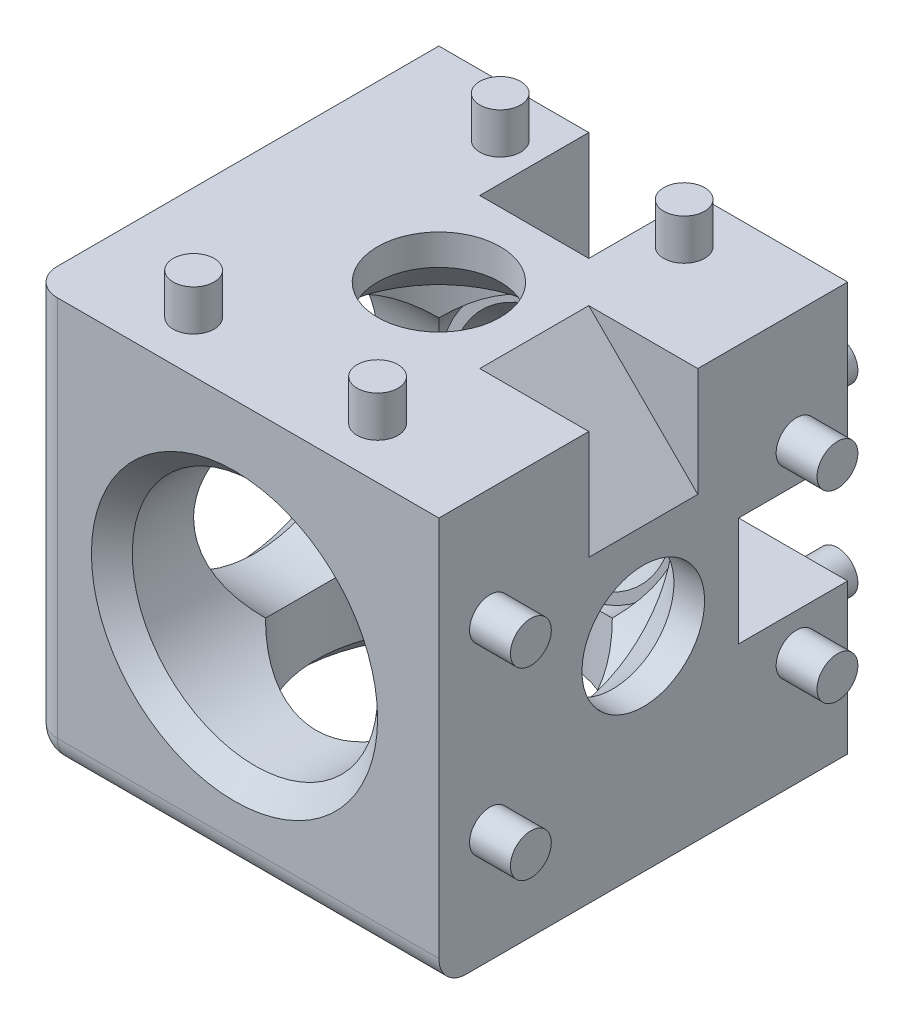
ISO-10303-21;
HEADER;
FILE_DESCRIPTION(('STEP AP214'),'2;1');
FILE_NAME('part.step','',(''),(''),'','','');
FILE_SCHEMA(('AUTOMOTIVE_DESIGN { 1 0 10303 214 1 1 1 1 }'));
ENDSEC;
DATA;
#1=APPLICATION_CONTEXT('core data for automotive mechanical design processes');
#2=APPLICATION_PROTOCOL_DEFINITION('international standard','automotive_design',2000,#1);
#3=PRODUCT_CONTEXT('',#1,'mechanical');
#4=PRODUCT('Part','Part','',(#3));
#5=PRODUCT_RELATED_PRODUCT_CATEGORY('part','',(#4));
#6=PRODUCT_DEFINITION_FORMATION('','',#4);
#7=PRODUCT_DEFINITION_CONTEXT('part definition',#1,'design');
#8=PRODUCT_DEFINITION('design','',#6,#7);
#9=PRODUCT_DEFINITION_SHAPE('','',#8);
#10=(LENGTH_UNIT() NAMED_UNIT(*) SI_UNIT(.MILLI.,.METRE.));
#11=(NAMED_UNIT(*) PLANE_ANGLE_UNIT() SI_UNIT($,.RADIAN.));
#12=(NAMED_UNIT(*) SI_UNIT($,.STERADIAN.) SOLID_ANGLE_UNIT());
#13=UNCERTAINTY_MEASURE_WITH_UNIT(LENGTH_MEASURE(1.E-05),#10,'distance_accuracy_value','');
#14=(GEOMETRIC_REPRESENTATION_CONTEXT(3) GLOBAL_UNCERTAINTY_ASSIGNED_CONTEXT((#13)) GLOBAL_UNIT_ASSIGNED_CONTEXT((#10,
#11,#12)) REPRESENTATION_CONTEXT('',''));
#15=CARTESIAN_POINT('',(0.,0.,0.));
#16=DIRECTION('',(0.,0.,1.));
#17=DIRECTION('',(1.,0.,0.));
#18=AXIS2_PLACEMENT_3D('',#15,#16,#17);
#19=CARTESIAN_POINT('',(9.,0.,15.));
#20=DIRECTION('',(-1.,0.,0.));
#21=DIRECTION('',(0.,0.,1.));
#22=AXIS2_PLACEMENT_3D('',#19,#20,#21);
#23=CYLINDRICAL_SURFACE('',#22,9.);
#24=CARTESIAN_POINT('',(0.,0.,15.));
#25=DIRECTION('',(-0.707106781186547,0.,0.707106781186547));
#26=DIRECTION('',(-0.707106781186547,0.,-0.707106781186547));
#27=AXIS2_PLACEMENT_3D('',#24,#25,#26);
#28=ELLIPSE('',#27,12.7279220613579,9.);
#29=CARTESIAN_POINT('',(9.,0.,24.));
#30=VERTEX_POINT('',#29);
#31=CARTESIAN_POINT('',(6.36396103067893,6.36396103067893,21.3639610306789));
#32=VERTEX_POINT('',#31);
#33=EDGE_CURVE('E177',#30,#32,#28,.T.);
#34=ORIENTED_EDGE('',*,*,#33,.T.);
#35=CARTESIAN_POINT('',(0.,0.,15.));
#36=DIRECTION('',(-0.707106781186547,0.707106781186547,0.));
#37=DIRECTION('',(-0.707106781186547,-0.707106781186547,0.));
#38=AXIS2_PLACEMENT_3D('',#35,#36,#37);
#39=ELLIPSE('',#38,12.7279220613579,9.);
#40=CARTESIAN_POINT('',(9.,9.,15.));
#41=VERTEX_POINT('',#40);
#42=EDGE_CURVE('E20',#32,#41,#39,.T.);
#43=ORIENTED_EDGE('',*,*,#42,.T.);
#44=CARTESIAN_POINT('',(9.,0.,15.));
#45=DIRECTION('',(-1.,0.,0.));
#46=DIRECTION('',(0.,0.,1.));
#47=AXIS2_PLACEMENT_3D('',#44,#45,#46);
#48=CIRCLE('',#47,9.);
#49=EDGE_CURVE('E184',#30,#41,#48,.T.);
#50=ORIENTED_EDGE('',*,*,#49,.F.);
#51=EDGE_LOOP('',(#34,#43,#50));
#52=FACE_BOUND('',#51,.T.);
#53=ADVANCED_FACE('F16',(#52),#23,.F.);
#54=CARTESIAN_POINT('',(0.,9.,15.));
#55=DIRECTION('',(0.,-1.,0.));
#56=DIRECTION('',(0.,0.,-1.));
#57=AXIS2_PLACEMENT_3D('',#54,#55,#56);
#58=CYLINDRICAL_SURFACE('',#57,9.);
#59=CARTESIAN_POINT('',(0.,9.,15.));
#60=DIRECTION('',(0.,-1.,0.));
#61=DIRECTION('',(0.,0.,-1.));
#62=AXIS2_PLACEMENT_3D('',#59,#60,#61);
#63=CIRCLE('',#62,9.);
#64=CARTESIAN_POINT('',(0.,9.,24.));
#65=VERTEX_POINT('',#64);
#66=EDGE_CURVE('E167',#41,#65,#63,.T.);
#67=ORIENTED_EDGE('',*,*,#66,.F.);
#68=ORIENTED_EDGE('',*,*,#42,.F.);
#69=CARTESIAN_POINT('',(0.,0.,15.));
#70=DIRECTION('',(0.,-0.707106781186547,0.707106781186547));
#71=DIRECTION('',(0.,-0.707106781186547,-0.707106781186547));
#72=AXIS2_PLACEMENT_3D('',#69,#70,#71);
#73=ELLIPSE('',#72,12.7279220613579,9.);
#74=EDGE_CURVE('E165',#32,#65,#73,.T.);
#75=ORIENTED_EDGE('',*,*,#74,.T.);
#76=EDGE_LOOP('',(#67,#68,#75));
#77=FACE_BOUND('',#76,.T.);
#78=ADVANCED_FACE('F164',(#77),#58,.F.);
#79=CARTESIAN_POINT('',(0.,9.,15.));
#80=DIRECTION('',(0.,-1.,0.));
#81=DIRECTION('',(0.,0.,-1.));
#82=AXIS2_PLACEMENT_3D('',#79,#80,#81);
#83=CYLINDRICAL_SURFACE('',#82,9.);
#84=CARTESIAN_POINT('',(0.,0.,15.));
#85=DIRECTION('',(0.,-0.707106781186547,-0.707106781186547));
#86=DIRECTION('',(0.,-0.707106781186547,0.707106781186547));
#87=AXIS2_PLACEMENT_3D('',#84,#85,#86);
#88=ELLIPSE('',#87,12.7279220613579,9.);
#89=CARTESIAN_POINT('',(0.,9.,6.));
#90=VERTEX_POINT('',#89);
#91=CARTESIAN_POINT('',(6.36396103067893,6.36396103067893,8.63603896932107));
#92=VERTEX_POINT('',#91);
#93=EDGE_CURVE('E210',#90,#92,#88,.T.);
#94=ORIENTED_EDGE('',*,*,#93,.T.);
#95=CARTESIAN_POINT('',(0.,0.,15.));
#96=DIRECTION('',(0.707106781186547,-0.707106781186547,0.));
#97=DIRECTION('',(-0.707106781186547,-0.707106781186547,0.));
#98=AXIS2_PLACEMENT_3D('',#95,#96,#97);
#99=ELLIPSE('',#98,12.7279220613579,9.);
#100=EDGE_CURVE('E172',#92,#41,#99,.T.);
#101=ORIENTED_EDGE('',*,*,#100,.T.);
#102=CARTESIAN_POINT('',(0.,9.,15.));
#103=DIRECTION('',(0.,-1.,0.));
#104=DIRECTION('',(0.,0.,-1.));
#105=AXIS2_PLACEMENT_3D('',#102,#103,#104);
#106=CIRCLE('',#105,9.);
#107=EDGE_CURVE('E191',#90,#41,#106,.T.);
#108=ORIENTED_EDGE('',*,*,#107,.F.);
#109=EDGE_LOOP('',(#94,#101,#108));
#110=FACE_BOUND('',#109,.T.);
#111=ADVANCED_FACE('F208',(#110),#83,.F.);
#112=CARTESIAN_POINT('',(9.,0.,15.));
#113=DIRECTION('',(-1.,0.,0.));
#114=DIRECTION('',(0.,0.,1.));
#115=AXIS2_PLACEMENT_3D('',#112,#113,#114);
#116=CYLINDRICAL_SURFACE('',#115,9.);
#117=CARTESIAN_POINT('',(9.,0.,15.));
#118=DIRECTION('',(-1.,0.,0.));
#119=DIRECTION('',(0.,0.,1.));
#120=AXIS2_PLACEMENT_3D('',#117,#118,#119);
#121=CIRCLE('',#120,9.);
#122=CARTESIAN_POINT('',(9.,0.,6.));
#123=VERTEX_POINT('',#122);
#124=EDGE_CURVE('E201',#41,#123,#121,.T.);
#125=ORIENTED_EDGE('',*,*,#124,.F.);
#126=ORIENTED_EDGE('',*,*,#100,.F.);
#127=CARTESIAN_POINT('',(0.,0.,15.));
#128=DIRECTION('',(-0.707106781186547,0.,-0.707106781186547));
#129=DIRECTION('',(-0.707106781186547,0.,0.707106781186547));
#130=AXIS2_PLACEMENT_3D('',#127,#128,#129);
#131=ELLIPSE('',#130,12.7279220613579,9.);
#132=EDGE_CURVE('E215',#92,#123,#131,.T.);
#133=ORIENTED_EDGE('',*,*,#132,.T.);
#134=EDGE_LOOP('',(#125,#126,#133));
#135=FACE_BOUND('',#134,.T.);
#136=ADVANCED_FACE('F214',(#135),#116,.F.);
#137=CARTESIAN_POINT('',(0.,9.,15.));
#138=DIRECTION('',(0.,-1.,0.));
#139=DIRECTION('',(0.,0.,-1.));
#140=AXIS2_PLACEMENT_3D('',#137,#138,#139);
#141=CYLINDRICAL_SURFACE('',#140,9.);
#142=CARTESIAN_POINT('',(0.,0.,15.));
#143=DIRECTION('',(0.,-0.707106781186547,0.707106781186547));
#144=DIRECTION('',(0.,-0.707106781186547,-0.707106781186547));
#145=AXIS2_PLACEMENT_3D('',#142,#143,#144);
#146=ELLIPSE('',#145,12.7279220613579,9.);
#147=CARTESIAN_POINT('',(-6.36396103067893,6.36396103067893,21.3639610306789));
#148=VERTEX_POINT('',#147);
#149=EDGE_CURVE('E180',#65,#148,#146,.T.);
#150=ORIENTED_EDGE('',*,*,#149,.T.);
#151=CARTESIAN_POINT('',(0.,0.,15.));
#152=DIRECTION('',(-0.707106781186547,-0.707106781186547,0.));
#153=DIRECTION('',(0.707106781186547,-0.707106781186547,0.));
#154=AXIS2_PLACEMENT_3D('',#151,#152,#153);
#155=ELLIPSE('',#154,12.7279220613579,9.);
#156=CARTESIAN_POINT('',(-9.,9.,15.));
#157=VERTEX_POINT('',#156);
#158=EDGE_CURVE('E280',#148,#157,#155,.T.);
#159=ORIENTED_EDGE('',*,*,#158,.T.);
#160=CARTESIAN_POINT('',(0.,9.,15.));
#161=DIRECTION('',(0.,-1.,0.));
#162=DIRECTION('',(0.,0.,-1.));
#163=AXIS2_PLACEMENT_3D('',#160,#161,#162);
#164=CIRCLE('',#163,9.);
#165=EDGE_CURVE('E195',#65,#157,#164,.T.);
#166=ORIENTED_EDGE('',*,*,#165,.F.);
#167=EDGE_LOOP('',(#150,#159,#166));
#168=FACE_BOUND('',#167,.T.);
#169=ADVANCED_FACE('F295',(#168),#141,.F.);
#170=CARTESIAN_POINT('',(0.,9.,15.));
#171=DIRECTION('',(0.,-1.,0.));
#172=DIRECTION('',(0.,0.,-1.));
#173=AXIS2_PLACEMENT_3D('',#170,#171,#172);
#174=CYLINDRICAL_SURFACE('',#173,9.);
#175=CARTESIAN_POINT('',(0.,9.,15.));
#176=DIRECTION('',(0.,-1.,0.));
#177=DIRECTION('',(0.,0.,-1.));
#178=AXIS2_PLACEMENT_3D('',#175,#176,#177);
#179=CIRCLE('',#178,9.);
#180=EDGE_CURVE('E193',#157,#90,#179,.T.);
#181=ORIENTED_EDGE('',*,*,#180,.F.);
#182=CARTESIAN_POINT('',(0.,0.,15.));
#183=DIRECTION('',(-0.707106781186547,-0.707106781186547,0.));
#184=DIRECTION('',(0.707106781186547,-0.707106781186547,0.));
#185=AXIS2_PLACEMENT_3D('',#182,#183,#184);
#186=ELLIPSE('',#185,12.7279220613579,9.);
#187=CARTESIAN_POINT('',(-6.36396103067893,6.36396103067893,8.63603896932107));
#188=VERTEX_POINT('',#187);
#189=EDGE_CURVE('E277',#157,#188,#186,.T.);
#190=ORIENTED_EDGE('',*,*,#189,.T.);
#191=CARTESIAN_POINT('',(0.,0.,15.));
#192=DIRECTION('',(0.,-0.707106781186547,-0.707106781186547));
#193=DIRECTION('',(0.,-0.707106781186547,0.707106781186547));
#194=AXIS2_PLACEMENT_3D('',#191,#192,#193);
#195=ELLIPSE('',#194,12.7279220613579,9.);
#196=EDGE_CURVE('E289',#188,#90,#195,.T.);
#197=ORIENTED_EDGE('',*,*,#196,.T.);
#198=EDGE_LOOP('',(#181,#190,#197));
#199=FACE_BOUND('',#198,.T.);
#200=ADVANCED_FACE('F316',(#199),#174,.F.);
#201=CARTESIAN_POINT('',(9.,0.,15.));
#202=DIRECTION('',(-1.,0.,0.));
#203=DIRECTION('',(0.,0.,1.));
#204=AXIS2_PLACEMENT_3D('',#201,#202,#203);
#205=CYLINDRICAL_SURFACE('',#204,9.);
#206=CARTESIAN_POINT('',(0.,0.,15.));
#207=DIRECTION('',(-0.707106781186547,0.,-0.707106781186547));
#208=DIRECTION('',(-0.707106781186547,0.,0.707106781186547));
#209=AXIS2_PLACEMENT_3D('',#206,#207,#208);
#210=ELLIPSE('',#209,12.7279220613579,9.);
#211=CARTESIAN_POINT('',(6.36396103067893,-6.36396103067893,8.63603896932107));
#212=VERTEX_POINT('',#211);
#213=EDGE_CURVE('E287',#123,#212,#210,.T.);
#214=ORIENTED_EDGE('',*,*,#213,.T.);
#215=CARTESIAN_POINT('',(0.,0.,15.));
#216=DIRECTION('',(-0.707106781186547,-0.707106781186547,0.));
#217=DIRECTION('',(-0.707106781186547,0.707106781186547,0.));
#218=AXIS2_PLACEMENT_3D('',#215,#216,#217);
#219=ELLIPSE('',#218,12.7279220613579,9.);
#220=CARTESIAN_POINT('',(9.,-9.,15.));
#221=VERTEX_POINT('',#220);
#222=EDGE_CURVE('E265',#212,#221,#219,.T.);
#223=ORIENTED_EDGE('',*,*,#222,.T.);
#224=CARTESIAN_POINT('',(9.,0.,15.));
#225=DIRECTION('',(-1.,0.,0.));
#226=DIRECTION('',(0.,0.,1.));
#227=AXIS2_PLACEMENT_3D('',#224,#225,#226);
#228=CIRCLE('',#227,9.);
#229=EDGE_CURVE('E199',#123,#221,#228,.T.);
#230=ORIENTED_EDGE('',*,*,#229,.F.);
#231=EDGE_LOOP('',(#214,#223,#230));
#232=FACE_BOUND('',#231,.T.);
#233=ADVANCED_FACE('F1249',(#232),#205,.F.);
#234=CARTESIAN_POINT('',(9.,0.,15.));
#235=DIRECTION('',(-1.,0.,0.));
#236=DIRECTION('',(0.,0.,1.));
#237=AXIS2_PLACEMENT_3D('',#234,#235,#236);
#238=CYLINDRICAL_SURFACE('',#237,9.);
#239=CARTESIAN_POINT('',(9.,0.,15.));
#240=DIRECTION('',(-1.,0.,0.));
#241=DIRECTION('',(0.,0.,1.));
#242=AXIS2_PLACEMENT_3D('',#239,#240,#241);
#243=CIRCLE('',#242,9.);
#244=EDGE_CURVE('E197',#221,#30,#243,.T.);
#245=ORIENTED_EDGE('',*,*,#244,.F.);
#246=CARTESIAN_POINT('',(0.,0.,15.));
#247=DIRECTION('',(-0.707106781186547,-0.707106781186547,0.));
#248=DIRECTION('',(-0.707106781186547,0.707106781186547,0.));
#249=AXIS2_PLACEMENT_3D('',#246,#247,#248);
#250=ELLIPSE('',#249,12.7279220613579,9.);
#251=CARTESIAN_POINT('',(6.36396103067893,-6.36396103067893,21.3639610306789));
#252=VERTEX_POINT('',#251);
#253=EDGE_CURVE('E262',#221,#252,#250,.T.);
#254=ORIENTED_EDGE('',*,*,#253,.T.);
#255=CARTESIAN_POINT('',(0.,0.,15.));
#256=DIRECTION('',(-0.707106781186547,0.,0.707106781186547));
#257=DIRECTION('',(-0.707106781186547,0.,-0.707106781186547));
#258=AXIS2_PLACEMENT_3D('',#255,#256,#257);
#259=ELLIPSE('',#258,12.7279220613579,9.);
#260=EDGE_CURVE('E185',#252,#30,#259,.T.);
#261=ORIENTED_EDGE('',*,*,#260,.T.);
#262=EDGE_LOOP('',(#245,#254,#261));
#263=FACE_BOUND('',#262,.T.);
#264=ADVANCED_FACE('F1241',(#263),#238,.F.);
#265=CARTESIAN_POINT('',(9.,0.,15.));
#266=DIRECTION('',(-1.,0.,0.));
#267=DIRECTION('',(0.,0.,1.));
#268=AXIS2_PLACEMENT_3D('',#265,#266,#267);
#269=PLANE('',#268);
#270=ORIENTED_EDGE('',*,*,#229,.T.);
#271=ORIENTED_EDGE('',*,*,#244,.T.);
#272=ORIENTED_EDGE('',*,*,#49,.T.);
#273=ORIENTED_EDGE('',*,*,#124,.T.);
#274=EDGE_LOOP('',(#270,#271,#272,#273));
#275=FACE_BOUND('',#274,.T.);
#276=CARTESIAN_POINT('',(8.99999999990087,0.,15.));
#277=DIRECTION('',(-1.,0.,0.));
#278=DIRECTION('',(0.,0.,1.));
#279=AXIS2_PLACEMENT_3D('',#276,#277,#278);
#280=CIRCLE('',#279,8.25000000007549);
#281=CARTESIAN_POINT('',(8.99999999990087,0.,23.2500000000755));
#282=VERTEX_POINT('',#281);
#283=EDGE_CURVE('E256',#282,#282,#280,.F.);
#284=ORIENTED_EDGE('',*,*,#283,.T.);
#285=EDGE_LOOP('',(#284));
#286=FACE_BOUND('',#285,.T.);
#287=ADVANCED_FACE('F219',(#275,#286),#269,.T.);
#288=CARTESIAN_POINT('',(0.,9.,15.));
#289=DIRECTION('',(0.,-1.,0.));
#290=DIRECTION('',(0.,0.,-1.));
#291=AXIS2_PLACEMENT_3D('',#288,#289,#290);
#292=PLANE('',#291);
#293=ORIENTED_EDGE('',*,*,#107,.T.);
#294=ORIENTED_EDGE('',*,*,#66,.T.);
#295=ORIENTED_EDGE('',*,*,#165,.T.);
#296=ORIENTED_EDGE('',*,*,#180,.T.);
#297=EDGE_LOOP('',(#293,#294,#295,#296));
#298=FACE_BOUND('',#297,.T.);
#299=CARTESIAN_POINT('',(0.,8.99999999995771,15.));
#300=DIRECTION('',(0.,-1.,0.));
#301=DIRECTION('',(0.,0.,-1.));
#302=AXIS2_PLACEMENT_3D('',#299,#300,#301);
#303=CIRCLE('',#302,8.25000000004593);
#304=CARTESIAN_POINT('',(0.,8.99999999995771,6.74999999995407));
#305=VERTEX_POINT('',#304);
#306=EDGE_CURVE('E253',#305,#305,#303,.F.);
#307=ORIENTED_EDGE('',*,*,#306,.T.);
#308=EDGE_LOOP('',(#307));
#309=FACE_BOUND('',#308,.T.);
#310=ADVANCED_FACE('F318',(#298,#309),#292,.T.);
#311=CARTESIAN_POINT('',(0.,0.,6.));
#312=DIRECTION('',(0.,0.,1.));
#313=DIRECTION('',(1.,0.,0.));
#314=AXIS2_PLACEMENT_3D('',#311,#312,#313);
#315=CYLINDRICAL_SURFACE('',#314,9.);
#316=ORIENTED_EDGE('',*,*,#33,.F.);
#317=ORIENTED_EDGE('',*,*,#260,.F.);
#318=CARTESIAN_POINT('',(0.,0.,15.));
#319=DIRECTION('',(0.,0.707106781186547,0.707106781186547));
#320=DIRECTION('',(0.,-0.707106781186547,0.707106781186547));
#321=AXIS2_PLACEMENT_3D('',#318,#319,#320);
#322=ELLIPSE('',#321,12.7279220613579,9.);
#323=CARTESIAN_POINT('',(-6.36396103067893,-6.36396103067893,21.3639610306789));
#324=VERTEX_POINT('',#323);
#325=EDGE_CURVE('E259',#252,#324,#322,.F.);
#326=ORIENTED_EDGE('',*,*,#325,.T.);
#327=CARTESIAN_POINT('',(0.,0.,15.));
#328=DIRECTION('',(0.707106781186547,0.,0.707106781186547));
#329=DIRECTION('',(-0.707106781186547,0.,0.707106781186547));
#330=AXIS2_PLACEMENT_3D('',#327,#328,#329);
#331=ELLIPSE('',#330,12.7279220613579,9.);
#332=EDGE_CURVE('E283',#324,#148,#331,.F.);
#333=ORIENTED_EDGE('',*,*,#332,.T.);
#334=ORIENTED_EDGE('',*,*,#149,.F.);
#335=ORIENTED_EDGE('',*,*,#74,.F.);
#336=EDGE_LOOP('',(#316,#317,#326,#333,#334,#335));
#337=FACE_BOUND('',#336,.T.);
#338=CARTESIAN_POINT('',(0.,0.,28.5));
#339=DIRECTION('',(0.,0.,1.));
#340=DIRECTION('',(1.,0.,0.));
#341=AXIS2_PLACEMENT_3D('',#338,#339,#340);
#342=CIRCLE('',#341,9.);
#343=CARTESIAN_POINT('',(9.,0.,28.5));
#344=VERTEX_POINT('',#343);
#345=EDGE_CURVE('E231',#344,#344,#342,.T.);
#346=ORIENTED_EDGE('',*,*,#345,.T.);
#347=EDGE_LOOP('',(#346));
#348=FACE_BOUND('',#347,.T.);
#349=ADVANCED_FACE('F175',(#337,#348),#315,.F.);
#350=CARTESIAN_POINT('',(0.,0.,6.));
#351=DIRECTION('',(0.,0.,1.));
#352=DIRECTION('',(1.,0.,0.));
#353=AXIS2_PLACEMENT_3D('',#350,#351,#352);
#354=CYLINDRICAL_SURFACE('',#353,9.);
#355=ORIENTED_EDGE('',*,*,#132,.F.);
#356=ORIENTED_EDGE('',*,*,#93,.F.);
#357=CARTESIAN_POINT('',(0.,0.,6.));
#358=DIRECTION('',(0.,0.,1.));
#359=DIRECTION('',(1.,0.,0.));
#360=AXIS2_PLACEMENT_3D('',#357,#358,#359);
#361=CIRCLE('',#360,9.);
#362=EDGE_CURVE('E225',#123,#90,#361,.T.);
#363=ORIENTED_EDGE('',*,*,#362,.F.);
#364=EDGE_LOOP('',(#355,#356,#363));
#365=FACE_BOUND('',#364,.T.);
#366=ADVANCED_FACE('F227',(#365),#354,.F.);
#367=CARTESIAN_POINT('',(0.,0.,6.));
#368=DIRECTION('',(0.,0.,1.));
#369=DIRECTION('',(1.,0.,0.));
#370=AXIS2_PLACEMENT_3D('',#367,#368,#369);
#371=CYLINDRICAL_SURFACE('',#370,9.);
#372=CARTESIAN_POINT('',(0.,0.,6.));
#373=DIRECTION('',(0.,0.,1.));
#374=DIRECTION('',(1.,0.,0.));
#375=AXIS2_PLACEMENT_3D('',#372,#373,#374);
#376=CIRCLE('',#375,9.);
#377=CARTESIAN_POINT('',(-9.,0.,6.));
#378=VERTEX_POINT('',#377);
#379=EDGE_CURVE('E230',#90,#378,#376,.T.);
#380=ORIENTED_EDGE('',*,*,#379,.F.);
#381=ORIENTED_EDGE('',*,*,#196,.F.);
#382=CARTESIAN_POINT('',(0.,0.,15.));
#383=DIRECTION('',(-0.707106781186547,0.,0.707106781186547));
#384=DIRECTION('',(0.707106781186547,0.,0.707106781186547));
#385=AXIS2_PLACEMENT_3D('',#382,#383,#384);
#386=ELLIPSE('',#385,12.7279220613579,9.);
#387=EDGE_CURVE('E274',#188,#378,#386,.T.);
#388=ORIENTED_EDGE('',*,*,#387,.T.);
#389=EDGE_LOOP('',(#380,#381,#388));
#390=FACE_BOUND('',#389,.T.);
#391=ADVANCED_FACE('F314',(#390),#371,.F.);
#392=CARTESIAN_POINT('',(0.,0.,6.));
#393=DIRECTION('',(0.,0.,1.));
#394=DIRECTION('',(1.,0.,0.));
#395=AXIS2_PLACEMENT_3D('',#392,#393,#394);
#396=CYLINDRICAL_SURFACE('',#395,9.);
#397=CARTESIAN_POINT('',(0.,0.,15.));
#398=DIRECTION('',(-0.707106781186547,0.,0.707106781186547));
#399=DIRECTION('',(0.707106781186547,0.,0.707106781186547));
#400=AXIS2_PLACEMENT_3D('',#397,#398,#399);
#401=ELLIPSE('',#400,12.7279220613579,9.);
#402=CARTESIAN_POINT('',(-6.36396103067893,-6.36396103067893,8.63603896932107));
#403=VERTEX_POINT('',#402);
#404=EDGE_CURVE('E285',#378,#403,#401,.T.);
#405=ORIENTED_EDGE('',*,*,#404,.T.);
#406=CARTESIAN_POINT('',(0.,0.,15.));
#407=DIRECTION('',(0.,-0.707106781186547,0.707106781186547));
#408=DIRECTION('',(0.,0.707106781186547,0.707106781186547));
#409=AXIS2_PLACEMENT_3D('',#406,#407,#408);
#410=ELLIPSE('',#409,12.7279220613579,9.);
#411=CARTESIAN_POINT('',(0.,-9.,6.));
#412=VERTEX_POINT('',#411);
#413=EDGE_CURVE('E269',#403,#412,#410,.T.);
#414=ORIENTED_EDGE('',*,*,#413,.T.);
#415=CARTESIAN_POINT('',(0.,0.,6.));
#416=DIRECTION('',(0.,0.,1.));
#417=DIRECTION('',(1.,0.,0.));
#418=AXIS2_PLACEMENT_3D('',#415,#416,#417);
#419=CIRCLE('',#418,9.);
#420=EDGE_CURVE('E239',#378,#412,#419,.T.);
#421=ORIENTED_EDGE('',*,*,#420,.F.);
#422=EDGE_LOOP('',(#405,#414,#421));
#423=FACE_BOUND('',#422,.T.);
#424=ADVANCED_FACE('F311',(#423),#396,.F.);
#425=CARTESIAN_POINT('',(0.,0.,6.));
#426=DIRECTION('',(0.,0.,1.));
#427=DIRECTION('',(1.,0.,0.));
#428=AXIS2_PLACEMENT_3D('',#425,#426,#427);
#429=CYLINDRICAL_SURFACE('',#428,9.);
#430=CARTESIAN_POINT('',(0.,0.,6.));
#431=DIRECTION('',(0.,0.,1.));
#432=DIRECTION('',(1.,0.,0.));
#433=AXIS2_PLACEMENT_3D('',#430,#431,#432);
#434=CIRCLE('',#433,9.);
#435=EDGE_CURVE('E235',#412,#123,#434,.T.);
#436=ORIENTED_EDGE('',*,*,#435,.F.);
#437=CARTESIAN_POINT('',(0.,0.,15.));
#438=DIRECTION('',(0.,-0.707106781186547,0.707106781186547));
#439=DIRECTION('',(0.,0.707106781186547,0.707106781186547));
#440=AXIS2_PLACEMENT_3D('',#437,#438,#439);
#441=ELLIPSE('',#440,12.7279220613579,9.);
#442=EDGE_CURVE('E267',#412,#212,#441,.T.);
#443=ORIENTED_EDGE('',*,*,#442,.T.);
#444=ORIENTED_EDGE('',*,*,#213,.F.);
#445=EDGE_LOOP('',(#436,#443,#444));
#446=FACE_BOUND('',#445,.T.);
#447=ADVANCED_FACE('F1193',(#446),#429,.F.);
#448=CARTESIAN_POINT('',(9.,0.,15.));
#449=DIRECTION('',(-1.,0.,0.));
#450=DIRECTION('',(0.,0.,1.));
#451=AXIS2_PLACEMENT_3D('',#448,#449,#450);
#452=CYLINDRICAL_SURFACE('',#451,9.);
#453=ORIENTED_EDGE('',*,*,#332,.F.);
#454=CARTESIAN_POINT('',(0.,0.,15.));
#455=DIRECTION('',(-0.707106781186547,0.707106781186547,0.));
#456=DIRECTION('',(-0.707106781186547,-0.707106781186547,0.));
#457=AXIS2_PLACEMENT_3D('',#454,#455,#456);
#458=ELLIPSE('',#457,12.7279220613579,9.);
#459=EDGE_CURVE('E271',#324,#403,#458,.F.);
#460=ORIENTED_EDGE('',*,*,#459,.T.);
#461=ORIENTED_EDGE('',*,*,#404,.F.);
#462=ORIENTED_EDGE('',*,*,#387,.F.);
#463=ORIENTED_EDGE('',*,*,#189,.F.);
#464=ORIENTED_EDGE('',*,*,#158,.F.);
#465=EDGE_LOOP('',(#453,#460,#461,#462,#463,#464));
#466=FACE_BOUND('',#465,.T.);
#467=CARTESIAN_POINT('',(-13.5,0.,15.));
#468=DIRECTION('',(-1.,0.,0.));
#469=DIRECTION('',(0.,0.,1.));
#470=AXIS2_PLACEMENT_3D('',#467,#468,#469);
#471=CIRCLE('',#470,9.);
#472=CARTESIAN_POINT('',(-13.5,0.,24.));
#473=VERTEX_POINT('',#472);
#474=EDGE_CURVE('E242',#473,#473,#471,.T.);
#475=ORIENTED_EDGE('',*,*,#474,.T.);
#476=EDGE_LOOP('',(#475));
#477=FACE_BOUND('',#476,.T.);
#478=ADVANCED_FACE('F298',(#466,#477),#452,.F.);
#479=CARTESIAN_POINT('',(0.,9.,15.));
#480=DIRECTION('',(0.,-1.,0.));
#481=DIRECTION('',(0.,0.,-1.));
#482=AXIS2_PLACEMENT_3D('',#479,#480,#481);
#483=CYLINDRICAL_SURFACE('',#482,9.);
#484=ORIENTED_EDGE('',*,*,#442,.F.);
#485=ORIENTED_EDGE('',*,*,#413,.F.);
#486=ORIENTED_EDGE('',*,*,#459,.F.);
#487=ORIENTED_EDGE('',*,*,#325,.F.);
#488=ORIENTED_EDGE('',*,*,#253,.F.);
#489=ORIENTED_EDGE('',*,*,#222,.F.);
#490=EDGE_LOOP('',(#484,#485,#486,#487,#488,#489));
#491=FACE_BOUND('',#490,.T.);
#492=CARTESIAN_POINT('',(0.,-13.5,15.));
#493=DIRECTION('',(0.,-1.,0.));
#494=DIRECTION('',(0.,0.,-1.));
#495=AXIS2_PLACEMENT_3D('',#492,#493,#494);
#496=CIRCLE('',#495,9.);
#497=CARTESIAN_POINT('',(0.,-13.5,6.));
#498=VERTEX_POINT('',#497);
#499=EDGE_CURVE('E245',#498,#498,#496,.T.);
#500=ORIENTED_EDGE('',*,*,#499,.T.);
#501=EDGE_LOOP('',(#500));
#502=FACE_BOUND('',#501,.T.);
#503=ADVANCED_FACE('F308',(#491,#502),#483,.F.);
#504=CARTESIAN_POINT('',(8.99999999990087,0.,15.));
#505=DIRECTION('',(-1.,0.,0.));
#506=DIRECTION('',(0.,0.,1.));
#507=AXIS2_PLACEMENT_3D('',#504,#505,#506);
#508=CONICAL_SURFACE('',#507,8.25000000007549,0.785398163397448);
#509=ORIENTED_EDGE('',*,*,#283,.F.);
#510=EDGE_LOOP('',(#509));
#511=FACE_BOUND('',#510,.T.);
#512=CARTESIAN_POINT('',(12.75,0.,15.));
#513=DIRECTION('',(-1.,0.,0.));
#514=DIRECTION('',(0.,0.,1.));
#515=AXIS2_PLACEMENT_3D('',#512,#513,#514);
#516=CIRCLE('',#515,4.5);
#517=CARTESIAN_POINT('',(12.75,0.,19.5));
#518=VERTEX_POINT('',#517);
#519=EDGE_CURVE('E346',#518,#518,#516,.F.);
#520=ORIENTED_EDGE('',*,*,#519,.T.);
#521=EDGE_LOOP('',(#520));
#522=FACE_BOUND('',#521,.T.);
#523=ADVANCED_FACE('F477',(#511,#522),#508,.F.);
#524=CARTESIAN_POINT('',(18.,-6.75,26.2499999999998));
#525=DIRECTION('',(-1.,0.,0.));
#526=DIRECTION('',(0.,-1.,0.));
#527=AXIS2_PLACEMENT_3D('',#524,#525,#526);
#528=PLANE('',#527);
#529=CARTESIAN_POINT('',(18.,-6.75,26.2499999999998));
#530=DIRECTION('',(-1.,0.,0.));
#531=DIRECTION('',(0.,-1.,0.));
#532=AXIS2_PLACEMENT_3D('',#529,#530,#531);
#533=CIRCLE('',#532,1.5);
#534=CARTESIAN_POINT('',(18.,-8.25,26.2499999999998));
#535=VERTEX_POINT('',#534);
#536=EDGE_CURVE('E349',#535,#535,#533,.T.);
#537=ORIENTED_EDGE('',*,*,#536,.F.);
#538=EDGE_LOOP('',(#537));
#539=FACE_BOUND('',#538,.T.);
#540=ADVANCED_FACE('F474',(#539),#528,.F.);
#541=CARTESIAN_POINT('',(18.,-6.75,3.74999999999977));
#542=DIRECTION('',(-1.,0.,0.));
#543=DIRECTION('',(0.,-1.,0.));
#544=AXIS2_PLACEMENT_3D('',#541,#542,#543);
#545=PLANE('',#544);
#546=CARTESIAN_POINT('',(18.,-6.75,3.74999999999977));
#547=DIRECTION('',(-1.,0.,0.));
#548=DIRECTION('',(0.,-1.,0.));
#549=AXIS2_PLACEMENT_3D('',#546,#547,#548);
#550=CIRCLE('',#549,1.5);
#551=CARTESIAN_POINT('',(18.,-8.25,3.74999999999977));
#552=VERTEX_POINT('',#551);
#553=EDGE_CURVE('E466',#552,#552,#550,.T.);
#554=ORIENTED_EDGE('',*,*,#553,.F.);
#555=EDGE_LOOP('',(#554));
#556=FACE_BOUND('',#555,.T.);
#557=ADVANCED_FACE('F476',(#556),#545,.F.);
#558=CARTESIAN_POINT('',(18.,6.75,3.74999999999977));
#559=DIRECTION('',(-1.,0.,0.));
#560=DIRECTION('',(0.,-1.,0.));
#561=AXIS2_PLACEMENT_3D('',#558,#559,#560);
#562=PLANE('',#561);
#563=CARTESIAN_POINT('',(18.,6.75,3.74999999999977));
#564=DIRECTION('',(-1.,0.,0.));
#565=DIRECTION('',(0.,-1.,0.));
#566=AXIS2_PLACEMENT_3D('',#563,#564,#565);
#567=CIRCLE('',#566,1.5);
#568=CARTESIAN_POINT('',(18.,5.25,3.74999999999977));
#569=VERTEX_POINT('',#568);
#570=EDGE_CURVE('E340',#569,#569,#567,.T.);
#571=ORIENTED_EDGE('',*,*,#570,.F.);
#572=EDGE_LOOP('',(#571));
#573=FACE_BOUND('',#572,.T.);
#574=ADVANCED_FACE('F484',(#573),#562,.F.);
#575=CARTESIAN_POINT('',(18.,6.75,26.2499999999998));
#576=DIRECTION('',(-1.,0.,0.));
#577=DIRECTION('',(0.,-1.,0.));
#578=AXIS2_PLACEMENT_3D('',#575,#576,#577);
#579=PLANE('',#578);
#580=CARTESIAN_POINT('',(18.,6.75,26.2499999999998));
#581=DIRECTION('',(-1.,0.,0.));
#582=DIRECTION('',(0.,-1.,0.));
#583=AXIS2_PLACEMENT_3D('',#580,#581,#582);
#584=CIRCLE('',#583,1.5);
#585=CARTESIAN_POINT('',(18.,5.25,26.2499999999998));
#586=VERTEX_POINT('',#585);
#587=EDGE_CURVE('E335',#586,#586,#584,.T.);
#588=ORIENTED_EDGE('',*,*,#587,.F.);
#589=EDGE_LOOP('',(#588));
#590=FACE_BOUND('',#589,.T.);
#591=ADVANCED_FACE('F328',(#590),#579,.F.);
#592=CARTESIAN_POINT('',(0.,8.99999999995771,15.));
#593=DIRECTION('',(0.,-1.,0.));
#594=DIRECTION('',(0.,0.,-1.));
#595=AXIS2_PLACEMENT_3D('',#592,#593,#594);
#596=CONICAL_SURFACE('',#595,8.25000000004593,0.785398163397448);
#597=ORIENTED_EDGE('',*,*,#306,.F.);
#598=EDGE_LOOP('',(#597));
#599=FACE_BOUND('',#598,.T.);
#600=CARTESIAN_POINT('',(0.,12.75,15.));
#601=DIRECTION('',(0.,-1.,0.));
#602=DIRECTION('',(0.,0.,-1.));
#603=AXIS2_PLACEMENT_3D('',#600,#601,#602);
#604=CIRCLE('',#603,4.5);
#605=CARTESIAN_POINT('',(0.,12.75,10.5));
#606=VERTEX_POINT('',#605);
#607=EDGE_CURVE('E332',#606,#606,#604,.F.);
#608=ORIENTED_EDGE('',*,*,#607,.T.);
#609=EDGE_LOOP('',(#608));
#610=FACE_BOUND('',#609,.T.);
#611=ADVANCED_FACE('F324',(#599,#610),#596,.F.);
#612=CARTESIAN_POINT('',(0.,0.,30.));
#613=DIRECTION('',(0.,0.,1.));
#614=DIRECTION('',(0.,-1.,0.));
#615=AXIS2_PLACEMENT_3D('',#612,#613,#614);
#616=CONICAL_SURFACE('',#615,10.5,0.785398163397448);
#617=ORIENTED_EDGE('',*,*,#345,.F.);
#618=EDGE_LOOP('',(#617));
#619=FACE_BOUND('',#618,.T.);
#620=CARTESIAN_POINT('',(0.,0.,30.));
#621=DIRECTION('',(0.,0.,1.));
#622=DIRECTION('',(0.,-1.,0.));
#623=AXIS2_PLACEMENT_3D('',#620,#621,#622);
#624=CIRCLE('',#623,10.5);
#625=CARTESIAN_POINT('',(0.,-10.5,30.));
#626=VERTEX_POINT('',#625);
#627=EDGE_CURVE('E460',#626,#626,#624,.T.);
#628=ORIENTED_EDGE('',*,*,#627,.T.);
#629=EDGE_LOOP('',(#628));
#630=FACE_BOUND('',#629,.T.);
#631=ADVANCED_FACE('F327',(#619,#630),#616,.F.);
#632=CARTESIAN_POINT('',(-6.75,18.,3.75));
#633=DIRECTION('',(0.,-1.,0.));
#634=DIRECTION('',(0.,0.,-1.));
#635=AXIS2_PLACEMENT_3D('',#632,#633,#634);
#636=PLANE('',#635);
#637=CARTESIAN_POINT('',(-6.75,18.,3.75));
#638=DIRECTION('',(0.,-1.,0.));
#639=DIRECTION('',(0.,0.,-1.));
#640=AXIS2_PLACEMENT_3D('',#637,#638,#639);
#641=CIRCLE('',#640,1.5);
#642=CARTESIAN_POINT('',(-6.75,18.,2.25));
#643=VERTEX_POINT('',#642);
#644=EDGE_CURVE('E453',#643,#643,#641,.T.);
#645=ORIENTED_EDGE('',*,*,#644,.F.);
#646=EDGE_LOOP('',(#645));
#647=FACE_BOUND('',#646,.T.);
#648=ADVANCED_FACE('F663',(#647),#636,.F.);
#649=CARTESIAN_POINT('',(-6.75,18.,26.25));
#650=DIRECTION('',(0.,-1.,0.));
#651=DIRECTION('',(0.,0.,-1.));
#652=AXIS2_PLACEMENT_3D('',#649,#650,#651);
#653=PLANE('',#652);
#654=CARTESIAN_POINT('',(-6.75,18.,26.25));
#655=DIRECTION('',(0.,-1.,0.));
#656=DIRECTION('',(0.,0.,-1.));
#657=AXIS2_PLACEMENT_3D('',#654,#655,#656);
#658=CIRCLE('',#657,1.5);
#659=CARTESIAN_POINT('',(-6.75,18.,24.75));
#660=VERTEX_POINT('',#659);
#661=EDGE_CURVE('E450',#660,#660,#658,.T.);
#662=ORIENTED_EDGE('',*,*,#661,.F.);
#663=EDGE_LOOP('',(#662));
#664=FACE_BOUND('',#663,.T.);
#665=ADVANCED_FACE('F659',(#664),#653,.F.);
#666=CARTESIAN_POINT('',(6.75,18.,26.25));
#667=DIRECTION('',(0.,-1.,0.));
#668=DIRECTION('',(0.,0.,-1.));
#669=AXIS2_PLACEMENT_3D('',#666,#667,#668);
#670=PLANE('',#669);
#671=CARTESIAN_POINT('',(6.75,18.,26.25));
#672=DIRECTION('',(0.,-1.,0.));
#673=DIRECTION('',(0.,0.,-1.));
#674=AXIS2_PLACEMENT_3D('',#671,#672,#673);
#675=CIRCLE('',#674,1.5);
#676=CARTESIAN_POINT('',(6.75,18.,24.75));
#677=VERTEX_POINT('',#676);
#678=EDGE_CURVE('E447',#677,#677,#675,.T.);
#679=ORIENTED_EDGE('',*,*,#678,.F.);
#680=EDGE_LOOP('',(#679));
#681=FACE_BOUND('',#680,.T.);
#682=ADVANCED_FACE('F655',(#681),#670,.F.);
#683=CARTESIAN_POINT('',(6.75,18.,3.75));
#684=DIRECTION('',(0.,-1.,0.));
#685=DIRECTION('',(0.,0.,-1.));
#686=AXIS2_PLACEMENT_3D('',#683,#684,#685);
#687=PLANE('',#686);
#688=CARTESIAN_POINT('',(6.75,18.,3.75));
#689=DIRECTION('',(0.,-1.,0.));
#690=DIRECTION('',(0.,0.,-1.));
#691=AXIS2_PLACEMENT_3D('',#688,#689,#690);
#692=CIRCLE('',#691,1.5);
#693=CARTESIAN_POINT('',(6.75,18.,2.25));
#694=VERTEX_POINT('',#693);
#695=EDGE_CURVE('E444',#694,#694,#692,.T.);
#696=ORIENTED_EDGE('',*,*,#695,.F.);
#697=EDGE_LOOP('',(#696));
#698=FACE_BOUND('',#697,.T.);
#699=ADVANCED_FACE('F652',(#698),#687,.F.);
#700=CARTESIAN_POINT('',(0.,0.,6.));
#701=DIRECTION('',(0.,0.,1.));
#702=DIRECTION('',(1.,0.,0.));
#703=AXIS2_PLACEMENT_3D('',#700,#701,#702);
#704=PLANE('',#703);
#705=ORIENTED_EDGE('',*,*,#420,.T.);
#706=ORIENTED_EDGE('',*,*,#435,.T.);
#707=ORIENTED_EDGE('',*,*,#362,.T.);
#708=ORIENTED_EDGE('',*,*,#379,.T.);
#709=EDGE_LOOP('',(#705,#706,#707,#708));
#710=FACE_BOUND('',#709,.T.);
#711=CARTESIAN_POINT('',(0.,0.,6.00000000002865));
#712=DIRECTION('',(0.,0.,1.));
#713=DIRECTION('',(1.,0.,0.));
#714=AXIS2_PLACEMENT_3D('',#711,#712,#713);
#715=CIRCLE('',#714,8.25000000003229);
#716=CARTESIAN_POINT('',(8.25000000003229,0.,6.00000000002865));
#717=VERTEX_POINT('',#716);
#718=EDGE_CURVE('E441',#717,#717,#715,.F.);
#719=ORIENTED_EDGE('',*,*,#718,.T.);
#720=EDGE_LOOP('',(#719));
#721=FACE_BOUND('',#720,.T.);
#722=ADVANCED_FACE('F236',(#710,#721),#704,.T.);
#723=CARTESIAN_POINT('',(-15.,0.,15.));
#724=DIRECTION('',(-1.,0.,0.));
#725=DIRECTION('',(0.,-1.,0.));
#726=AXIS2_PLACEMENT_3D('',#723,#724,#725);
#727=CONICAL_SURFACE('',#726,10.5,0.785398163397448);
#728=ORIENTED_EDGE('',*,*,#474,.F.);
#729=EDGE_LOOP('',(#728));
#730=FACE_BOUND('',#729,.T.);
#731=CARTESIAN_POINT('',(-15.,0.,15.));
#732=DIRECTION('',(-1.,0.,0.));
#733=DIRECTION('',(0.,-1.,0.));
#734=AXIS2_PLACEMENT_3D('',#731,#732,#733);
#735=CIRCLE('',#734,10.5);
#736=CARTESIAN_POINT('',(-15.,-10.5,15.));
#737=VERTEX_POINT('',#736);
#738=EDGE_CURVE('E438',#737,#737,#735,.F.);
#739=ORIENTED_EDGE('',*,*,#738,.F.);
#740=EDGE_LOOP('',(#739));
#741=FACE_BOUND('',#740,.T.);
#742=ADVANCED_FACE('F646',(#730,#741),#727,.F.);
#743=CARTESIAN_POINT('',(-13.0000000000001,-13.,28.));
#744=DIRECTION('',(0.126598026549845,0.204592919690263,0.970625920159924));
#745=DIRECTION('',(-0.99190853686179,0.0354885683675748,0.121893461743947));
#746=AXIS2_PLACEMENT_3D('',#743,#744,#745);
#747=SPHERICAL_SURFACE('',#746,1.9999999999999);
#748=CARTESIAN_POINT('',(-13.,-13.,28.));
#749=DIRECTION('',(0.,0.,1.));
#750=DIRECTION('',(1.,0.,0.));
#751=AXIS2_PLACEMENT_3D('',#748,#749,#750);
#752=CIRCLE('',#751,2.);
#753=CARTESIAN_POINT('',(-13.,-15.,28.));
#754=VERTEX_POINT('',#753);
#755=CARTESIAN_POINT('',(-15.,-13.,28.));
#756=VERTEX_POINT('',#755);
#757=EDGE_CURVE('E433',#754,#756,#752,.F.);
#758=ORIENTED_EDGE('',*,*,#757,.F.);
#759=CARTESIAN_POINT('',(-13.,-13.,28.));
#760=DIRECTION('',(1.,0.,0.));
#761=DIRECTION('',(0.,0.,-1.));
#762=AXIS2_PLACEMENT_3D('',#759,#760,#761);
#763=CIRCLE('',#762,2.);
#764=CARTESIAN_POINT('',(-13.,-13.,30.));
#765=VERTEX_POINT('',#764);
#766=EDGE_CURVE('E249',#765,#754,#763,.T.);
#767=ORIENTED_EDGE('',*,*,#766,.F.);
#768=CARTESIAN_POINT('',(-13.,-13.,28.));
#769=DIRECTION('',(0.,1.,0.));
#770=DIRECTION('',(0.,0.,1.));
#771=AXIS2_PLACEMENT_3D('',#768,#769,#770);
#772=CIRCLE('',#771,2.);
#773=EDGE_CURVE('E457',#756,#765,#772,.T.);
#774=ORIENTED_EDGE('',*,*,#773,.F.);
#775=EDGE_LOOP('',(#758,#767,#774));
#776=FACE_BOUND('',#775,.T.);
#777=ADVANCED_FACE('F18',(#776),#747,.T.);
#778=CARTESIAN_POINT('',(0.,-15.,15.));
#779=DIRECTION('',(0.,-1.,0.));
#780=DIRECTION('',(1.,0.,0.));
#781=AXIS2_PLACEMENT_3D('',#778,#779,#780);
#782=CONICAL_SURFACE('',#781,10.5,0.785398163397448);
#783=ORIENTED_EDGE('',*,*,#499,.F.);
#784=EDGE_LOOP('',(#783));
#785=FACE_BOUND('',#784,.T.);
#786=CARTESIAN_POINT('',(0.,-15.,15.));
#787=DIRECTION('',(0.,-1.,0.));
#788=DIRECTION('',(1.,0.,0.));
#789=AXIS2_PLACEMENT_3D('',#786,#787,#788);
#790=CIRCLE('',#789,10.5);
#791=CARTESIAN_POINT('',(10.5,-15.,15.));
#792=VERTEX_POINT('',#791);
#793=EDGE_CURVE('E428',#792,#792,#790,.T.);
#794=ORIENTED_EDGE('',*,*,#793,.T.);
#795=EDGE_LOOP('',(#794));
#796=FACE_BOUND('',#795,.T.);
#797=ADVANCED_FACE('F641',(#785,#796),#782,.F.);
#798=CARTESIAN_POINT('',(0.,-13.,28.));
#799=DIRECTION('',(1.,0.,0.));
#800=DIRECTION('',(0.,0.,-1.));
#801=AXIS2_PLACEMENT_3D('',#798,#799,#800);
#802=CYLINDRICAL_SURFACE('',#801,2.);
#803=CARTESIAN_POINT('',(15.,-13.,28.));
#804=DIRECTION('',(1.,0.,0.));
#805=DIRECTION('',(0.,0.,-1.));
#806=AXIS2_PLACEMENT_3D('',#803,#804,#805);
#807=CIRCLE('',#806,2.);
#808=CARTESIAN_POINT('',(15.,-15.,28.));
#809=VERTEX_POINT('',#808);
#810=CARTESIAN_POINT('',(15.,-13.,30.));
#811=VERTEX_POINT('',#810);
#812=EDGE_CURVE('E423',#809,#811,#807,.F.);
#813=ORIENTED_EDGE('',*,*,#812,.T.);
#814=DIRECTION('',(-1.,0.,0.));
#815=VECTOR('',#814,1.);
#816=CARTESIAN_POINT('',(0.,-13.,30.));
#817=LINE('',#816,#815);
#818=EDGE_CURVE('E462',#811,#765,#817,.T.);
#819=ORIENTED_EDGE('',*,*,#818,.T.);
#820=ORIENTED_EDGE('',*,*,#766,.T.);
#821=DIRECTION('',(1.,0.,0.));
#822=VECTOR('',#821,1.);
#823=CARTESIAN_POINT('',(0.,-15.,28.));
#824=LINE('',#823,#822);
#825=EDGE_CURVE('E344',#754,#809,#824,.T.);
#826=ORIENTED_EDGE('',*,*,#825,.T.);
#827=EDGE_LOOP('',(#813,#819,#820,#826));
#828=FACE_BOUND('',#827,.T.);
#829=ADVANCED_FACE('F637',(#828),#802,.T.);
#830=CARTESIAN_POINT('',(15.,0.,15.));
#831=DIRECTION('',(-1.,0.,0.));
#832=DIRECTION('',(0.,0.,1.));
#833=AXIS2_PLACEMENT_3D('',#830,#831,#832);
#834=CYLINDRICAL_SURFACE('',#833,4.5);
#835=ORIENTED_EDGE('',*,*,#519,.F.);
#836=EDGE_LOOP('',(#835));
#837=FACE_BOUND('',#836,.T.);
#838=CARTESIAN_POINT('',(15.,0.,15.));
#839=DIRECTION('',(-1.,0.,0.));
#840=DIRECTION('',(0.,0.,1.));
#841=AXIS2_PLACEMENT_3D('',#838,#839,#840);
#842=CIRCLE('',#841,4.5);
#843=CARTESIAN_POINT('',(15.,0.,19.5));
#844=VERTEX_POINT('',#843);
#845=EDGE_CURVE('E419',#844,#844,#842,.F.);
#846=ORIENTED_EDGE('',*,*,#845,.T.);
#847=EDGE_LOOP('',(#846));
#848=FACE_BOUND('',#847,.T.);
#849=ADVANCED_FACE('F634',(#837,#848),#834,.F.);
#850=CARTESIAN_POINT('',(18.,-6.75,26.2499999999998));
#851=DIRECTION('',(-1.,0.,0.));
#852=DIRECTION('',(0.,-1.,0.));
#853=AXIS2_PLACEMENT_3D('',#850,#851,#852);
#854=CYLINDRICAL_SURFACE('',#853,1.5);
#855=ORIENTED_EDGE('',*,*,#536,.T.);
#856=EDGE_LOOP('',(#855));
#857=FACE_BOUND('',#856,.T.);
#858=CARTESIAN_POINT('',(15.,-6.75,26.2499999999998));
#859=DIRECTION('',(-1.,0.,0.));
#860=DIRECTION('',(0.,-1.,0.));
#861=AXIS2_PLACEMENT_3D('',#858,#859,#860);
#862=CIRCLE('',#861,1.5);
#863=CARTESIAN_POINT('',(15.,-8.25,26.2499999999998));
#864=VERTEX_POINT('',#863);
#865=EDGE_CURVE('E416',#864,#864,#862,.F.);
#866=ORIENTED_EDGE('',*,*,#865,.T.);
#867=EDGE_LOOP('',(#866));
#868=FACE_BOUND('',#867,.T.);
#869=ADVANCED_FACE('F471',(#857,#868),#854,.T.);
#870=CARTESIAN_POINT('',(18.,-6.75,3.74999999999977));
#871=DIRECTION('',(-1.,0.,0.));
#872=DIRECTION('',(0.,-1.,0.));
#873=AXIS2_PLACEMENT_3D('',#870,#871,#872);
#874=CYLINDRICAL_SURFACE('',#873,1.5);
#875=ORIENTED_EDGE('',*,*,#553,.T.);
#876=EDGE_LOOP('',(#875));
#877=FACE_BOUND('',#876,.T.);
#878=CARTESIAN_POINT('',(15.,-6.75,3.74999999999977));
#879=DIRECTION('',(-1.,0.,0.));
#880=DIRECTION('',(0.,-1.,0.));
#881=AXIS2_PLACEMENT_3D('',#878,#879,#880);
#882=CIRCLE('',#881,1.5);
#883=CARTESIAN_POINT('',(15.,-8.25,3.74999999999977));
#884=VERTEX_POINT('',#883);
#885=EDGE_CURVE('E413',#884,#884,#882,.F.);
#886=ORIENTED_EDGE('',*,*,#885,.T.);
#887=EDGE_LOOP('',(#886));
#888=FACE_BOUND('',#887,.T.);
#889=ADVANCED_FACE('F627',(#877,#888),#874,.T.);
#890=CARTESIAN_POINT('',(18.,6.75,3.74999999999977));
#891=DIRECTION('',(-1.,0.,0.));
#892=DIRECTION('',(0.,-1.,0.));
#893=AXIS2_PLACEMENT_3D('',#890,#891,#892);
#894=CYLINDRICAL_SURFACE('',#893,1.5);
#895=ORIENTED_EDGE('',*,*,#570,.T.);
#896=EDGE_LOOP('',(#895));
#897=FACE_BOUND('',#896,.T.);
#898=CARTESIAN_POINT('',(15.,6.75,3.74999999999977));
#899=DIRECTION('',(-1.,0.,0.));
#900=DIRECTION('',(0.,-1.,0.));
#901=AXIS2_PLACEMENT_3D('',#898,#899,#900);
#902=CIRCLE('',#901,1.5);
#903=CARTESIAN_POINT('',(15.,5.25,3.74999999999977));
#904=VERTEX_POINT('',#903);
#905=EDGE_CURVE('E410',#904,#904,#902,.F.);
#906=ORIENTED_EDGE('',*,*,#905,.T.);
#907=EDGE_LOOP('',(#906));
#908=FACE_BOUND('',#907,.T.);
#909=ADVANCED_FACE('F623',(#897,#908),#894,.T.);
#910=CARTESIAN_POINT('',(18.,6.75,26.2499999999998));
#911=DIRECTION('',(-1.,0.,0.));
#912=DIRECTION('',(0.,-1.,0.));
#913=AXIS2_PLACEMENT_3D('',#910,#911,#912);
#914=CYLINDRICAL_SURFACE('',#913,1.5);
#915=ORIENTED_EDGE('',*,*,#587,.T.);
#916=EDGE_LOOP('',(#915));
#917=FACE_BOUND('',#916,.T.);
#918=CARTESIAN_POINT('',(15.,6.75,26.2499999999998));
#919=DIRECTION('',(-1.,0.,0.));
#920=DIRECTION('',(0.,-1.,0.));
#921=AXIS2_PLACEMENT_3D('',#918,#919,#920);
#922=CIRCLE('',#921,1.5);
#923=CARTESIAN_POINT('',(15.,5.25,26.2499999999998));
#924=VERTEX_POINT('',#923);
#925=EDGE_CURVE('E407',#924,#924,#922,.F.);
#926=ORIENTED_EDGE('',*,*,#925,.T.);
#927=EDGE_LOOP('',(#926));
#928=FACE_BOUND('',#927,.T.);
#929=ADVANCED_FACE('F620',(#917,#928),#914,.T.);
#930=CARTESIAN_POINT('',(0.,15.,15.));
#931=DIRECTION('',(0.,-1.,0.));
#932=DIRECTION('',(0.,0.,-1.));
#933=AXIS2_PLACEMENT_3D('',#930,#931,#932);
#934=CYLINDRICAL_SURFACE('',#933,4.5);
#935=ORIENTED_EDGE('',*,*,#607,.F.);
#936=EDGE_LOOP('',(#935));
#937=FACE_BOUND('',#936,.T.);
#938=CARTESIAN_POINT('',(0.,15.,15.));
#939=DIRECTION('',(0.,-1.,0.));
#940=DIRECTION('',(0.,0.,-1.));
#941=AXIS2_PLACEMENT_3D('',#938,#939,#940);
#942=CIRCLE('',#941,4.5);
#943=CARTESIAN_POINT('',(0.,15.,10.5));
#944=VERTEX_POINT('',#943);
#945=EDGE_CURVE('E403',#944,#944,#942,.F.);
#946=ORIENTED_EDGE('',*,*,#945,.T.);
#947=EDGE_LOOP('',(#946));
#948=FACE_BOUND('',#947,.T.);
#949=ADVANCED_FACE('F616',(#937,#948),#934,.F.);
#950=CARTESIAN_POINT('',(12.1715728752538,12.1715728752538,11.));
#951=DIRECTION('',(0.,0.,1.));
#952=DIRECTION('',(1.,0.,0.));
#953=AXIS2_PLACEMENT_3D('',#950,#951,#952);
#954=PLANE('',#953);
#955=DIRECTION('',(0.707106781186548,-0.707106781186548,0.));
#956=VECTOR('',#955,1.);
#957=CARTESIAN_POINT('',(15.,7.,11.));
#958=LINE('',#957,#956);
#959=CARTESIAN_POINT('',(7.,15.,11.));
#960=VERTEX_POINT('',#959);
#961=CARTESIAN_POINT('',(15.,7.,11.));
#962=VERTEX_POINT('',#961);
#963=EDGE_CURVE('E334',#960,#962,#958,.T.);
#964=ORIENTED_EDGE('',*,*,#963,.T.);
#965=DIRECTION('',(0.,1.,0.));
#966=VECTOR('',#965,1.);
#967=CARTESIAN_POINT('',(15.,0.,11.));
#968=LINE('',#967,#966);
#969=CARTESIAN_POINT('',(15.,15.,11.));
#970=VERTEX_POINT('',#969);
#971=EDGE_CURVE('E703',#962,#970,#968,.T.);
#972=ORIENTED_EDGE('',*,*,#971,.T.);
#973=DIRECTION('',(1.,0.,0.));
#974=VECTOR('',#973,1.);
#975=CARTESIAN_POINT('',(0.,15.,11.));
#976=LINE('',#975,#974);
#977=EDGE_CURVE('E827',#970,#960,#976,.F.);
#978=ORIENTED_EDGE('',*,*,#977,.T.);
#979=EDGE_LOOP('',(#964,#972,#978));
#980=FACE_BOUND('',#979,.T.);
#981=ADVANCED_FACE('F612',(#980),#954,.T.);
#982=CARTESIAN_POINT('',(15.,7.,11.));
#983=DIRECTION('',(-0.707106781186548,-0.707106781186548,0.));
#984=DIRECTION('',(0.707106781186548,-0.707106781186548,0.));
#985=AXIS2_PLACEMENT_3D('',#982,#983,#984);
#986=PLANE('',#985);
#987=ORIENTED_EDGE('',*,*,#963,.F.);
#988=DIRECTION('',(0.,0.,-1.));
#989=VECTOR('',#988,1.);
#990=CARTESIAN_POINT('',(7.,15.,15.));
#991=LINE('',#990,#989);
#992=CARTESIAN_POINT('',(7.,15.,19.));
#993=VERTEX_POINT('',#992);
#994=EDGE_CURVE('E819',#960,#993,#991,.F.);
#995=ORIENTED_EDGE('',*,*,#994,.T.);
#996=DIRECTION('',(0.707106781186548,-0.707106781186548,0.));
#997=VECTOR('',#996,1.);
#998=CARTESIAN_POINT('',(7.,15.,19.));
#999=LINE('',#998,#997);
#1000=CARTESIAN_POINT('',(15.,7.,19.));
#1001=VERTEX_POINT('',#1000);
#1002=EDGE_CURVE('E337',#993,#1001,#999,.T.);
#1003=ORIENTED_EDGE('',*,*,#1002,.T.);
#1004=DIRECTION('',(0.,0.,1.));
#1005=VECTOR('',#1004,1.);
#1006=CARTESIAN_POINT('',(15.,7.,15.));
#1007=LINE('',#1006,#1005);
#1008=EDGE_CURVE('E814',#1001,#962,#1007,.F.);
#1009=ORIENTED_EDGE('',*,*,#1008,.T.);
#1010=EDGE_LOOP('',(#987,#995,#1003,#1009));
#1011=FACE_BOUND('',#1010,.T.);
#1012=ADVANCED_FACE('F608',(#1011),#986,.F.);
#1013=CARTESIAN_POINT('',(12.1715728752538,12.1715728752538,19.));
#1014=DIRECTION('',(0.,0.,1.));
#1015=DIRECTION('',(1.,0.,0.));
#1016=AXIS2_PLACEMENT_3D('',#1013,#1014,#1015);
#1017=PLANE('',#1016);
#1018=DIRECTION('',(0.,1.,0.));
#1019=VECTOR('',#1018,1.);
#1020=CARTESIAN_POINT('',(15.,0.,19.));
#1021=LINE('',#1020,#1019);
#1022=CARTESIAN_POINT('',(15.,15.,19.));
#1023=VERTEX_POINT('',#1022);
#1024=EDGE_CURVE('E744',#1023,#1001,#1021,.F.);
#1025=ORIENTED_EDGE('',*,*,#1024,.T.);
#1026=ORIENTED_EDGE('',*,*,#1002,.F.);
#1027=DIRECTION('',(1.,0.,0.));
#1028=VECTOR('',#1027,1.);
#1029=CARTESIAN_POINT('',(0.,15.,19.));
#1030=LINE('',#1029,#1028);
#1031=EDGE_CURVE('E809',#993,#1023,#1030,.T.);
#1032=ORIENTED_EDGE('',*,*,#1031,.T.);
#1033=EDGE_LOOP('',(#1025,#1026,#1032));
#1034=FACE_BOUND('',#1033,.T.);
#1035=ADVANCED_FACE('F604',(#1034),#1017,.F.);
#1036=CARTESIAN_POINT('',(0.,0.,30.));
#1037=DIRECTION('',(0.,0.,-1.));
#1038=DIRECTION('',(-1.,0.,0.));
#1039=AXIS2_PLACEMENT_3D('',#1036,#1037,#1038);
#1040=PLANE('',#1039);
#1041=ORIENTED_EDGE('',*,*,#627,.F.);
#1042=EDGE_LOOP('',(#1041));
#1043=FACE_BOUND('',#1042,.T.);
#1044=DIRECTION('',(0.,1.,0.));
#1045=VECTOR('',#1044,1.);
#1046=CARTESIAN_POINT('',(15.,0.,30.));
#1047=LINE('',#1046,#1045);
#1048=CARTESIAN_POINT('',(15.,15.,30.));
#1049=VERTEX_POINT('',#1048);
#1050=EDGE_CURVE('E426',#811,#1049,#1047,.T.);
#1051=ORIENTED_EDGE('',*,*,#1050,.T.);
#1052=DIRECTION('',(1.,0.,0.));
#1053=VECTOR('',#1052,1.);
#1054=CARTESIAN_POINT('',(0.,15.,30.));
#1055=LINE('',#1054,#1053);
#1056=CARTESIAN_POINT('',(-13.,15.,30.));
#1057=VERTEX_POINT('',#1056);
#1058=EDGE_CURVE('E402',#1049,#1057,#1055,.F.);
#1059=ORIENTED_EDGE('',*,*,#1058,.T.);
#1060=DIRECTION('',(0.,1.,0.));
#1061=VECTOR('',#1060,1.);
#1062=CARTESIAN_POINT('',(-13.,0.,30.));
#1063=LINE('',#1062,#1061);
#1064=EDGE_CURVE('E456',#765,#1057,#1063,.T.);
#1065=ORIENTED_EDGE('',*,*,#1064,.F.);
#1066=ORIENTED_EDGE('',*,*,#818,.F.);
#1067=EDGE_LOOP('',(#1051,#1059,#1065,#1066));
#1068=FACE_BOUND('',#1067,.T.);
#1069=ADVANCED_FACE('F600',(#1043,#1068),#1040,.F.);
#1070=CARTESIAN_POINT('',(-13.,0.,28.));
#1071=DIRECTION('',(0.,1.,0.));
#1072=DIRECTION('',(0.,0.,1.));
#1073=AXIS2_PLACEMENT_3D('',#1070,#1071,#1072);
#1074=CYLINDRICAL_SURFACE('',#1073,2.);
#1075=CARTESIAN_POINT('',(-13.,15.,28.));
#1076=DIRECTION('',(0.,1.,0.));
#1077=DIRECTION('',(0.,0.,1.));
#1078=AXIS2_PLACEMENT_3D('',#1075,#1076,#1077);
#1079=CIRCLE('',#1078,2.);
#1080=CARTESIAN_POINT('',(-15.,15.,28.));
#1081=VERTEX_POINT('',#1080);
#1082=EDGE_CURVE('E399',#1057,#1081,#1079,.F.);
#1083=ORIENTED_EDGE('',*,*,#1082,.T.);
#1084=DIRECTION('',(0.,1.,0.));
#1085=VECTOR('',#1084,1.);
#1086=CARTESIAN_POINT('',(-15.,0.,28.));
#1087=LINE('',#1086,#1085);
#1088=EDGE_CURVE('E437',#756,#1081,#1087,.T.);
#1089=ORIENTED_EDGE('',*,*,#1088,.F.);
#1090=ORIENTED_EDGE('',*,*,#773,.T.);
#1091=ORIENTED_EDGE('',*,*,#1064,.T.);
#1092=EDGE_LOOP('',(#1083,#1089,#1090,#1091));
#1093=FACE_BOUND('',#1092,.T.);
#1094=ADVANCED_FACE('F596',(#1093),#1074,.T.);
#1095=CARTESIAN_POINT('',(-6.75,18.,3.75));
#1096=DIRECTION('',(0.,-1.,0.));
#1097=DIRECTION('',(0.,0.,-1.));
#1098=AXIS2_PLACEMENT_3D('',#1095,#1096,#1097);
#1099=CYLINDRICAL_SURFACE('',#1098,1.5);
#1100=ORIENTED_EDGE('',*,*,#644,.T.);
#1101=EDGE_LOOP('',(#1100));
#1102=FACE_BOUND('',#1101,.T.);
#1103=CARTESIAN_POINT('',(-6.75,15.,3.75));
#1104=DIRECTION('',(0.,-1.,0.));
#1105=DIRECTION('',(0.,0.,-1.));
#1106=AXIS2_PLACEMENT_3D('',#1103,#1104,#1105);
#1107=CIRCLE('',#1106,1.5);
#1108=CARTESIAN_POINT('',(-6.75,15.,2.25));
#1109=VERTEX_POINT('',#1108);
#1110=EDGE_CURVE('E395',#1109,#1109,#1107,.F.);
#1111=ORIENTED_EDGE('',*,*,#1110,.T.);
#1112=EDGE_LOOP('',(#1111));
#1113=FACE_BOUND('',#1112,.T.);
#1114=ADVANCED_FACE('F592',(#1102,#1113),#1099,.T.);
#1115=CARTESIAN_POINT('',(-6.75,18.,26.25));
#1116=DIRECTION('',(0.,-1.,0.));
#1117=DIRECTION('',(0.,0.,-1.));
#1118=AXIS2_PLACEMENT_3D('',#1115,#1116,#1117);
#1119=CYLINDRICAL_SURFACE('',#1118,1.5);
#1120=ORIENTED_EDGE('',*,*,#661,.T.);
#1121=EDGE_LOOP('',(#1120));
#1122=FACE_BOUND('',#1121,.T.);
#1123=CARTESIAN_POINT('',(-6.75,15.,26.25));
#1124=DIRECTION('',(0.,-1.,0.));
#1125=DIRECTION('',(0.,0.,-1.));
#1126=AXIS2_PLACEMENT_3D('',#1123,#1124,#1125);
#1127=CIRCLE('',#1126,1.5);
#1128=CARTESIAN_POINT('',(-6.75,15.,24.75));
#1129=VERTEX_POINT('',#1128);
#1130=EDGE_CURVE('E392',#1129,#1129,#1127,.F.);
#1131=ORIENTED_EDGE('',*,*,#1130,.T.);
#1132=EDGE_LOOP('',(#1131));
#1133=FACE_BOUND('',#1132,.T.);
#1134=ADVANCED_FACE('F588',(#1122,#1133),#1119,.T.);
#1135=CARTESIAN_POINT('',(6.75,18.,26.25));
#1136=DIRECTION('',(0.,-1.,0.));
#1137=DIRECTION('',(0.,0.,-1.));
#1138=AXIS2_PLACEMENT_3D('',#1135,#1136,#1137);
#1139=CYLINDRICAL_SURFACE('',#1138,1.5);
#1140=ORIENTED_EDGE('',*,*,#678,.T.);
#1141=EDGE_LOOP('',(#1140));
#1142=FACE_BOUND('',#1141,.T.);
#1143=CARTESIAN_POINT('',(6.75,15.,26.25));
#1144=DIRECTION('',(0.,-1.,0.));
#1145=DIRECTION('',(0.,0.,-1.));
#1146=AXIS2_PLACEMENT_3D('',#1143,#1144,#1145);
#1147=CIRCLE('',#1146,1.5);
#1148=CARTESIAN_POINT('',(6.75,15.,24.75));
#1149=VERTEX_POINT('',#1148);
#1150=EDGE_CURVE('E389',#1149,#1149,#1147,.F.);
#1151=ORIENTED_EDGE('',*,*,#1150,.T.);
#1152=EDGE_LOOP('',(#1151));
#1153=FACE_BOUND('',#1152,.T.);
#1154=ADVANCED_FACE('F584',(#1142,#1153),#1139,.T.);
#1155=CARTESIAN_POINT('',(6.75,18.,3.75));
#1156=DIRECTION('',(0.,-1.,0.));
#1157=DIRECTION('',(0.,0.,-1.));
#1158=AXIS2_PLACEMENT_3D('',#1155,#1156,#1157);
#1159=CYLINDRICAL_SURFACE('',#1158,1.5);
#1160=ORIENTED_EDGE('',*,*,#695,.T.);
#1161=EDGE_LOOP('',(#1160));
#1162=FACE_BOUND('',#1161,.T.);
#1163=CARTESIAN_POINT('',(6.75,15.,3.75));
#1164=DIRECTION('',(0.,-1.,0.));
#1165=DIRECTION('',(0.,0.,-1.));
#1166=AXIS2_PLACEMENT_3D('',#1163,#1164,#1165);
#1167=CIRCLE('',#1166,1.5);
#1168=CARTESIAN_POINT('',(6.75,15.,2.25));
#1169=VERTEX_POINT('',#1168);
#1170=EDGE_CURVE('E385',#1169,#1169,#1167,.F.);
#1171=ORIENTED_EDGE('',*,*,#1170,.T.);
#1172=EDGE_LOOP('',(#1171));
#1173=FACE_BOUND('',#1172,.T.);
#1174=ADVANCED_FACE('F580',(#1162,#1173),#1159,.T.);
#1175=CARTESIAN_POINT('',(0.,0.,6.00000000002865));
#1176=DIRECTION('',(0.,0.,1.));
#1177=DIRECTION('',(1.,0.,0.));
#1178=AXIS2_PLACEMENT_3D('',#1175,#1176,#1177);
#1179=CONICAL_SURFACE('',#1178,8.25000000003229,0.785398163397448);
#1180=ORIENTED_EDGE('',*,*,#718,.F.);
#1181=EDGE_LOOP('',(#1180));
#1182=FACE_BOUND('',#1181,.T.);
#1183=CARTESIAN_POINT('',(0.,0.,2.25));
#1184=DIRECTION('',(0.,0.,1.));
#1185=DIRECTION('',(1.,0.,0.));
#1186=AXIS2_PLACEMENT_3D('',#1183,#1184,#1185);
#1187=CIRCLE('',#1186,4.5);
#1188=CARTESIAN_POINT('',(4.5,0.,2.25));
#1189=VERTEX_POINT('',#1188);
#1190=EDGE_CURVE('E384',#1189,#1189,#1187,.F.);
#1191=ORIENTED_EDGE('',*,*,#1190,.T.);
#1192=EDGE_LOOP('',(#1191));
#1193=FACE_BOUND('',#1192,.T.);
#1194=ADVANCED_FACE('F576',(#1182,#1193),#1179,.F.);
#1195=CARTESIAN_POINT('',(11.25,-6.75,-3.));
#1196=DIRECTION('',(0.,0.,1.));
#1197=DIRECTION('',(1.,0.,0.));
#1198=AXIS2_PLACEMENT_3D('',#1195,#1196,#1197);
#1199=PLANE('',#1198);
#1200=CARTESIAN_POINT('',(11.25,-6.75,-3.));
#1201=DIRECTION('',(0.,0.,1.));
#1202=DIRECTION('',(1.,0.,0.));
#1203=AXIS2_PLACEMENT_3D('',#1200,#1201,#1202);
#1204=CIRCLE('',#1203,1.5);
#1205=CARTESIAN_POINT('',(12.75,-6.75,-3.));
#1206=VERTEX_POINT('',#1205);
#1207=EDGE_CURVE('E381',#1206,#1206,#1204,.T.);
#1208=ORIENTED_EDGE('',*,*,#1207,.F.);
#1209=EDGE_LOOP('',(#1208));
#1210=FACE_BOUND('',#1209,.T.);
#1211=ADVANCED_FACE('F572',(#1210),#1199,.F.);
#1212=CARTESIAN_POINT('',(-11.25,-6.75,-3.));
#1213=DIRECTION('',(0.,0.,1.));
#1214=DIRECTION('',(1.,0.,0.));
#1215=AXIS2_PLACEMENT_3D('',#1212,#1213,#1214);
#1216=PLANE('',#1215);
#1217=CARTESIAN_POINT('',(-11.25,-6.75,-3.));
#1218=DIRECTION('',(0.,0.,1.));
#1219=DIRECTION('',(1.,0.,0.));
#1220=AXIS2_PLACEMENT_3D('',#1217,#1218,#1219);
#1221=CIRCLE('',#1220,1.5);
#1222=CARTESIAN_POINT('',(-9.75,-6.75,-3.));
#1223=VERTEX_POINT('',#1222);
#1224=EDGE_CURVE('E378',#1223,#1223,#1221,.T.);
#1225=ORIENTED_EDGE('',*,*,#1224,.F.);
#1226=EDGE_LOOP('',(#1225));
#1227=FACE_BOUND('',#1226,.T.);
#1228=ADVANCED_FACE('F568',(#1227),#1216,.F.);
#1229=CARTESIAN_POINT('',(-11.25,6.75,-3.));
#1230=DIRECTION('',(0.,0.,1.));
#1231=DIRECTION('',(1.,0.,0.));
#1232=AXIS2_PLACEMENT_3D('',#1229,#1230,#1231);
#1233=PLANE('',#1232);
#1234=CARTESIAN_POINT('',(-11.25,6.75,-3.));
#1235=DIRECTION('',(0.,0.,1.));
#1236=DIRECTION('',(1.,0.,0.));
#1237=AXIS2_PLACEMENT_3D('',#1234,#1235,#1236);
#1238=CIRCLE('',#1237,1.5);
#1239=CARTESIAN_POINT('',(-9.75,6.75,-3.));
#1240=VERTEX_POINT('',#1239);
#1241=EDGE_CURVE('E375',#1240,#1240,#1238,.T.);
#1242=ORIENTED_EDGE('',*,*,#1241,.F.);
#1243=EDGE_LOOP('',(#1242));
#1244=FACE_BOUND('',#1243,.T.);
#1245=ADVANCED_FACE('F564',(#1244),#1233,.F.);
#1246=CARTESIAN_POINT('',(11.25,6.75,-3.));
#1247=DIRECTION('',(0.,0.,1.));
#1248=DIRECTION('',(1.,0.,0.));
#1249=AXIS2_PLACEMENT_3D('',#1246,#1247,#1248);
#1250=PLANE('',#1249);
#1251=CARTESIAN_POINT('',(11.25,6.75,-3.));
#1252=DIRECTION('',(0.,0.,1.));
#1253=DIRECTION('',(1.,0.,0.));
#1254=AXIS2_PLACEMENT_3D('',#1251,#1252,#1253);
#1255=CIRCLE('',#1254,1.5);
#1256=CARTESIAN_POINT('',(12.75,6.75,-3.));
#1257=VERTEX_POINT('',#1256);
#1258=EDGE_CURVE('E371',#1257,#1257,#1255,.T.);
#1259=ORIENTED_EDGE('',*,*,#1258,.F.);
#1260=EDGE_LOOP('',(#1259));
#1261=FACE_BOUND('',#1260,.T.);
#1262=ADVANCED_FACE('F560',(#1261),#1250,.F.);
#1263=CARTESIAN_POINT('',(-4.,12.1715728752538,2.82842712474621));
#1264=DIRECTION('',(1.,0.,0.));
#1265=DIRECTION('',(0.,0.,-1.));
#1266=AXIS2_PLACEMENT_3D('',#1263,#1264,#1265);
#1267=PLANE('',#1266);
#1268=DIRECTION('',(0.,-0.707106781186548,-0.707106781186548));
#1269=VECTOR('',#1268,1.);
#1270=CARTESIAN_POINT('',(-4.,7.,0.));
#1271=LINE('',#1270,#1269);
#1272=CARTESIAN_POINT('',(-4.,15.,8.));
#1273=VERTEX_POINT('',#1272);
#1274=CARTESIAN_POINT('',(-4.,7.,0.));
#1275=VERTEX_POINT('',#1274);
#1276=EDGE_CURVE('E776',#1273,#1275,#1271,.T.);
#1277=ORIENTED_EDGE('',*,*,#1276,.T.);
#1278=DIRECTION('',(0.,1.,0.));
#1279=VECTOR('',#1278,1.);
#1280=CARTESIAN_POINT('',(-4.,0.,0.));
#1281=LINE('',#1280,#1279);
#1282=CARTESIAN_POINT('',(-4.,15.,0.));
#1283=VERTEX_POINT('',#1282);
#1284=EDGE_CURVE('E374',#1275,#1283,#1281,.T.);
#1285=ORIENTED_EDGE('',*,*,#1284,.T.);
#1286=DIRECTION('',(0.,0.,-1.));
#1287=VECTOR('',#1286,1.);
#1288=CARTESIAN_POINT('',(-4.,15.,15.));
#1289=LINE('',#1288,#1287);
#1290=EDGE_CURVE('E406',#1283,#1273,#1289,.F.);
#1291=ORIENTED_EDGE('',*,*,#1290,.T.);
#1292=EDGE_LOOP('',(#1277,#1285,#1291));
#1293=FACE_BOUND('',#1292,.T.);
#1294=ADVANCED_FACE('F556',(#1293),#1267,.T.);
#1295=CARTESIAN_POINT('',(-15.,0.,15.));
#1296=DIRECTION('',(-1.,0.,0.));
#1297=DIRECTION('',(0.,0.,1.));
#1298=AXIS2_PLACEMENT_3D('',#1295,#1296,#1297);
#1299=PLANE('',#1298);
#1300=ORIENTED_EDGE('',*,*,#1088,.T.);
#1301=DIRECTION('',(0.,0.,-1.));
#1302=VECTOR('',#1301,1.);
#1303=CARTESIAN_POINT('',(-15.,15.,15.));
#1304=LINE('',#1303,#1302);
#1305=CARTESIAN_POINT('',(-15.,15.,0.));
#1306=VERTEX_POINT('',#1305);
#1307=EDGE_CURVE('E398',#1081,#1306,#1304,.T.);
#1308=ORIENTED_EDGE('',*,*,#1307,.T.);
#1309=DIRECTION('',(0.,1.,0.));
#1310=VECTOR('',#1309,1.);
#1311=CARTESIAN_POINT('',(-15.,0.,0.));
#1312=LINE('',#1311,#1310);
#1313=CARTESIAN_POINT('',(-15.,-13.,0.));
#1314=VERTEX_POINT('',#1313);
#1315=EDGE_CURVE('E370',#1306,#1314,#1312,.F.);
#1316=ORIENTED_EDGE('',*,*,#1315,.T.);
#1317=DIRECTION('',(0.,0.,1.));
#1318=VECTOR('',#1317,1.);
#1319=CARTESIAN_POINT('',(-15.,-13.,15.));
#1320=LINE('',#1319,#1318);
#1321=EDGE_CURVE('E436',#756,#1314,#1320,.F.);
#1322=ORIENTED_EDGE('',*,*,#1321,.F.);
#1323=EDGE_LOOP('',(#1300,#1308,#1316,#1322));
#1324=FACE_BOUND('',#1323,.T.);
#1325=ORIENTED_EDGE('',*,*,#738,.T.);
#1326=EDGE_LOOP('',(#1325));
#1327=FACE_BOUND('',#1326,.T.);
#1328=ADVANCED_FACE('F552',(#1324,#1327),#1299,.T.);
#1329=CARTESIAN_POINT('',(-13.,-13.,15.));
#1330=DIRECTION('',(0.,0.,1.));
#1331=DIRECTION('',(1.,0.,0.));
#1332=AXIS2_PLACEMENT_3D('',#1329,#1330,#1331);
#1333=CYLINDRICAL_SURFACE('',#1332,2.);
#1334=CARTESIAN_POINT('',(-13.,-13.,0.));
#1335=DIRECTION('',(0.,0.,1.));
#1336=DIRECTION('',(1.,0.,0.));
#1337=AXIS2_PLACEMENT_3D('',#1334,#1335,#1336);
#1338=CIRCLE('',#1337,2.);
#1339=CARTESIAN_POINT('',(-13.,-15.,0.));
#1340=VERTEX_POINT('',#1339);
#1341=EDGE_CURVE('E366',#1314,#1340,#1338,.T.);
#1342=ORIENTED_EDGE('',*,*,#1341,.T.);
#1343=DIRECTION('',(0.,0.,1.));
#1344=VECTOR('',#1343,1.);
#1345=CARTESIAN_POINT('',(-13.,-15.,15.));
#1346=LINE('',#1345,#1344);
#1347=EDGE_CURVE('E432',#1340,#754,#1346,.T.);
#1348=ORIENTED_EDGE('',*,*,#1347,.T.);
#1349=ORIENTED_EDGE('',*,*,#757,.T.);
#1350=ORIENTED_EDGE('',*,*,#1321,.T.);
#1351=EDGE_LOOP('',(#1342,#1348,#1349,#1350));
#1352=FACE_BOUND('',#1351,.T.);
#1353=ADVANCED_FACE('F548',(#1352),#1333,.T.);
#1354=CARTESIAN_POINT('',(0.,-15.,15.));
#1355=DIRECTION('',(0.,1.,0.));
#1356=DIRECTION('',(0.,0.,1.));
#1357=AXIS2_PLACEMENT_3D('',#1354,#1355,#1356);
#1358=PLANE('',#1357);
#1359=ORIENTED_EDGE('',*,*,#793,.F.);
#1360=EDGE_LOOP('',(#1359));
#1361=FACE_BOUND('',#1360,.T.);
#1362=DIRECTION('',(1.,0.,0.));
#1363=VECTOR('',#1362,1.);
#1364=CARTESIAN_POINT('',(0.,-15.,0.));
#1365=LINE('',#1364,#1363);
#1366=CARTESIAN_POINT('',(15.,-15.,0.));
#1367=VERTEX_POINT('',#1366);
#1368=EDGE_CURVE('E369',#1340,#1367,#1365,.T.);
#1369=ORIENTED_EDGE('',*,*,#1368,.T.);
#1370=DIRECTION('',(0.,0.,1.));
#1371=VECTOR('',#1370,1.);
#1372=CARTESIAN_POINT('',(15.,-15.,15.));
#1373=LINE('',#1372,#1371);
#1374=EDGE_CURVE('E427',#1367,#809,#1373,.T.);
#1375=ORIENTED_EDGE('',*,*,#1374,.T.);
#1376=ORIENTED_EDGE('',*,*,#825,.F.);
#1377=ORIENTED_EDGE('',*,*,#1347,.F.);
#1378=EDGE_LOOP('',(#1369,#1375,#1376,#1377));
#1379=FACE_BOUND('',#1378,.T.);
#1380=ADVANCED_FACE('F544',(#1361,#1379),#1358,.F.);
#1381=CARTESIAN_POINT('',(12.1715728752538,-4.,2.82842712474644));
#1382=DIRECTION('',(0.,1.,0.));
#1383=DIRECTION('',(0.,0.,1.));
#1384=AXIS2_PLACEMENT_3D('',#1381,#1382,#1383);
#1385=PLANE('',#1384);
#1386=DIRECTION('',(0.707106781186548,0.,0.707106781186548));
#1387=VECTOR('',#1386,1.);
#1388=CARTESIAN_POINT('',(15.,-4.,8.00000000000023));
#1389=LINE('',#1388,#1387);
#1390=CARTESIAN_POINT('',(6.99999999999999,-4.,1.34820540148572E-13));
#1391=VERTEX_POINT('',#1390);
#1392=CARTESIAN_POINT('',(15.,-4.,8.00000000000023));
#1393=VERTEX_POINT('',#1392);
#1394=EDGE_CURVE('E431',#1391,#1393,#1389,.T.);
#1395=ORIENTED_EDGE('',*,*,#1394,.T.);
#1396=DIRECTION('',(0.,0.,1.));
#1397=VECTOR('',#1396,1.);
#1398=CARTESIAN_POINT('',(15.,-4.,15.));
#1399=LINE('',#1398,#1397);
#1400=CARTESIAN_POINT('',(15.,-4.,1.27610595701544E-13));
#1401=VERTEX_POINT('',#1400);
#1402=EDGE_CURVE('E749',#1393,#1401,#1399,.F.);
#1403=ORIENTED_EDGE('',*,*,#1402,.T.);
#1404=DIRECTION('',(1.,0.,0.));
#1405=VECTOR('',#1404,1.);
#1406=CARTESIAN_POINT('',(0.,-4.,0.));
#1407=LINE('',#1406,#1405);
#1408=EDGE_CURVE('E719',#1401,#1391,#1407,.F.);
#1409=ORIENTED_EDGE('',*,*,#1408,.T.);
#1410=EDGE_LOOP('',(#1395,#1403,#1409));
#1411=FACE_BOUND('',#1410,.T.);
#1412=ADVANCED_FACE('F540',(#1411),#1385,.T.);
#1413=CARTESIAN_POINT('',(15.,-4.,8.00000000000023));
#1414=DIRECTION('',(-0.707106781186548,0.,0.707106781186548));
#1415=DIRECTION('',(0.707106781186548,0.,0.707106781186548));
#1416=AXIS2_PLACEMENT_3D('',#1413,#1414,#1415);
#1417=PLANE('',#1416);
#1418=ORIENTED_EDGE('',*,*,#1394,.F.);
#1419=DIRECTION('',(0.,1.,0.));
#1420=VECTOR('',#1419,1.);
#1421=CARTESIAN_POINT('',(7.,0.,0.));
#1422=LINE('',#1421,#1420);
#1423=CARTESIAN_POINT('',(6.99999999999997,4.,1.2861001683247E-13));
#1424=VERTEX_POINT('',#1423);
#1425=EDGE_CURVE('E717',#1391,#1424,#1422,.T.);
#1426=ORIENTED_EDGE('',*,*,#1425,.T.);
#1427=DIRECTION('',(0.707106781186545,0.,0.70710678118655));
#1428=VECTOR('',#1427,1.);
#1429=CARTESIAN_POINT('',(7.,4.,1.69135538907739E-13));
#1430=LINE('',#1429,#1428);
#1431=CARTESIAN_POINT('',(15.,4.,8.00000000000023));
#1432=VERTEX_POINT('',#1431);
#1433=EDGE_CURVE('E716',#1424,#1432,#1430,.T.);
#1434=ORIENTED_EDGE('',*,*,#1433,.T.);
#1435=DIRECTION('',(0.,1.,0.));
#1436=VECTOR('',#1435,1.);
#1437=CARTESIAN_POINT('',(15.,0.,8.00000000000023));
#1438=LINE('',#1437,#1436);
#1439=EDGE_CURVE('E422',#1432,#1393,#1438,.F.);
#1440=ORIENTED_EDGE('',*,*,#1439,.T.);
#1441=EDGE_LOOP('',(#1418,#1426,#1434,#1440));
#1442=FACE_BOUND('',#1441,.T.);
#1443=ADVANCED_FACE('F536',(#1442),#1417,.F.);
#1444=CARTESIAN_POINT('',(12.1715728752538,4.,2.82842712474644));
#1445=DIRECTION('',(0.,1.,0.));
#1446=DIRECTION('',(0.,0.,1.));
#1447=AXIS2_PLACEMENT_3D('',#1444,#1445,#1446);
#1448=PLANE('',#1447);
#1449=DIRECTION('',(0.,0.,1.));
#1450=VECTOR('',#1449,1.);
#1451=CARTESIAN_POINT('',(15.,4.,15.));
#1452=LINE('',#1451,#1450);
#1453=CARTESIAN_POINT('',(15.,4.,0.));
#1454=VERTEX_POINT('',#1453);
#1455=EDGE_CURVE('E693',#1454,#1432,#1452,.T.);
#1456=ORIENTED_EDGE('',*,*,#1455,.T.);
#1457=ORIENTED_EDGE('',*,*,#1433,.F.);
#1458=DIRECTION('',(1.,0.,0.));
#1459=VECTOR('',#1458,1.);
#1460=CARTESIAN_POINT('',(0.,4.,0.));
#1461=LINE('',#1460,#1459);
#1462=EDGE_CURVE('E710',#1424,#1454,#1461,.T.);
#1463=ORIENTED_EDGE('',*,*,#1462,.T.);
#1464=EDGE_LOOP('',(#1456,#1457,#1463));
#1465=FACE_BOUND('',#1464,.T.);
#1466=ADVANCED_FACE('F532',(#1465),#1448,.F.);
#1467=CARTESIAN_POINT('',(15.,0.,15.));
#1468=DIRECTION('',(-1.,0.,0.));
#1469=DIRECTION('',(0.,0.,1.));
#1470=AXIS2_PLACEMENT_3D('',#1467,#1468,#1469);
#1471=PLANE('',#1470);
#1472=ORIENTED_EDGE('',*,*,#925,.F.);
#1473=EDGE_LOOP('',(#1472));
#1474=FACE_BOUND('',#1473,.T.);
#1475=ORIENTED_EDGE('',*,*,#905,.F.);
#1476=EDGE_LOOP('',(#1475));
#1477=FACE_BOUND('',#1476,.T.);
#1478=ORIENTED_EDGE('',*,*,#885,.F.);
#1479=EDGE_LOOP('',(#1478));
#1480=FACE_BOUND('',#1479,.T.);
#1481=ORIENTED_EDGE('',*,*,#865,.F.);
#1482=EDGE_LOOP('',(#1481));
#1483=FACE_BOUND('',#1482,.T.);
#1484=ORIENTED_EDGE('',*,*,#845,.F.);
#1485=EDGE_LOOP('',(#1484));
#1486=FACE_BOUND('',#1485,.T.);
#1487=ORIENTED_EDGE('',*,*,#1455,.F.);
#1488=DIRECTION('',(0.,1.,0.));
#1489=VECTOR('',#1488,1.);
#1490=CARTESIAN_POINT('',(15.,0.,0.));
#1491=LINE('',#1490,#1489);
#1492=CARTESIAN_POINT('',(15.,15.,0.));
#1493=VERTEX_POINT('',#1492);
#1494=EDGE_CURVE('E696',#1454,#1493,#1491,.T.);
#1495=ORIENTED_EDGE('',*,*,#1494,.T.);
#1496=DIRECTION('',(0.,0.,-1.));
#1497=VECTOR('',#1496,1.);
#1498=CARTESIAN_POINT('',(15.,15.,15.));
#1499=LINE('',#1498,#1497);
#1500=EDGE_CURVE('E769',#1493,#970,#1499,.F.);
#1501=ORIENTED_EDGE('',*,*,#1500,.T.);
#1502=ORIENTED_EDGE('',*,*,#971,.F.);
#1503=ORIENTED_EDGE('',*,*,#1008,.F.);
#1504=ORIENTED_EDGE('',*,*,#1024,.F.);
#1505=DIRECTION('',(0.,0.,-1.));
#1506=VECTOR('',#1505,1.);
#1507=CARTESIAN_POINT('',(15.,15.,15.));
#1508=LINE('',#1507,#1506);
#1509=EDGE_CURVE('E739',#1023,#1049,#1508,.F.);
#1510=ORIENTED_EDGE('',*,*,#1509,.T.);
#1511=ORIENTED_EDGE('',*,*,#1050,.F.);
#1512=ORIENTED_EDGE('',*,*,#812,.F.);
#1513=ORIENTED_EDGE('',*,*,#1374,.F.);
#1514=DIRECTION('',(0.,1.,0.));
#1515=VECTOR('',#1514,1.);
#1516=CARTESIAN_POINT('',(15.,0.,0.));
#1517=LINE('',#1516,#1515);
#1518=EDGE_CURVE('E724',#1367,#1401,#1517,.T.);
#1519=ORIENTED_EDGE('',*,*,#1518,.T.);
#1520=ORIENTED_EDGE('',*,*,#1402,.F.);
#1521=ORIENTED_EDGE('',*,*,#1439,.F.);
#1522=EDGE_LOOP('',(#1487,#1495,#1501,#1502,#1503,#1504,#1510,#1511,#1512,#1513,#1519,#1520,#1521));
#1523=FACE_BOUND('',#1522,.T.);
#1524=ADVANCED_FACE('F528',(#1474,#1477,#1480,#1483,#1486,#1523),#1471,.F.);
#1525=CARTESIAN_POINT('',(0.,15.,15.));
#1526=DIRECTION('',(0.,-1.,0.));
#1527=DIRECTION('',(0.,0.,-1.));
#1528=AXIS2_PLACEMENT_3D('',#1525,#1526,#1527);
#1529=PLANE('',#1528);
#1530=ORIENTED_EDGE('',*,*,#1170,.F.);
#1531=EDGE_LOOP('',(#1530));
#1532=FACE_BOUND('',#1531,.T.);
#1533=ORIENTED_EDGE('',*,*,#1150,.F.);
#1534=EDGE_LOOP('',(#1533));
#1535=FACE_BOUND('',#1534,.T.);
#1536=ORIENTED_EDGE('',*,*,#1130,.F.);
#1537=EDGE_LOOP('',(#1536));
#1538=FACE_BOUND('',#1537,.T.);
#1539=ORIENTED_EDGE('',*,*,#1110,.F.);
#1540=EDGE_LOOP('',(#1539));
#1541=FACE_BOUND('',#1540,.T.);
#1542=ORIENTED_EDGE('',*,*,#1307,.F.);
#1543=ORIENTED_EDGE('',*,*,#1082,.F.);
#1544=ORIENTED_EDGE('',*,*,#1058,.F.);
#1545=ORIENTED_EDGE('',*,*,#1509,.F.);
#1546=ORIENTED_EDGE('',*,*,#1031,.F.);
#1547=ORIENTED_EDGE('',*,*,#994,.F.);
#1548=ORIENTED_EDGE('',*,*,#977,.F.);
#1549=ORIENTED_EDGE('',*,*,#1500,.F.);
#1550=DIRECTION('',(1.,0.,0.));
#1551=VECTOR('',#1550,1.);
#1552=CARTESIAN_POINT('',(0.,15.,0.));
#1553=LINE('',#1552,#1551);
#1554=CARTESIAN_POINT('',(4.,15.,0.));
#1555=VERTEX_POINT('',#1554);
#1556=EDGE_CURVE('E713',#1493,#1555,#1553,.F.);
#1557=ORIENTED_EDGE('',*,*,#1556,.T.);
#1558=DIRECTION('',(0.,0.,-1.));
#1559=VECTOR('',#1558,1.);
#1560=CARTESIAN_POINT('',(4.,15.,2.82842712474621));
#1561=LINE('',#1560,#1559);
#1562=CARTESIAN_POINT('',(4.,15.,8.));
#1563=VERTEX_POINT('',#1562);
#1564=EDGE_CURVE('E388',#1555,#1563,#1561,.F.);
#1565=ORIENTED_EDGE('',*,*,#1564,.T.);
#1566=DIRECTION('',(1.,0.,0.));
#1567=VECTOR('',#1566,1.);
#1568=CARTESIAN_POINT('',(-4.,15.,8.));
#1569=LINE('',#1568,#1567);
#1570=EDGE_CURVE('E779',#1563,#1273,#1569,.F.);
#1571=ORIENTED_EDGE('',*,*,#1570,.T.);
#1572=ORIENTED_EDGE('',*,*,#1290,.F.);
#1573=DIRECTION('',(1.,0.,0.));
#1574=VECTOR('',#1573,1.);
#1575=CARTESIAN_POINT('',(0.,15.,0.));
#1576=LINE('',#1575,#1574);
#1577=EDGE_CURVE('E731',#1283,#1306,#1576,.F.);
#1578=ORIENTED_EDGE('',*,*,#1577,.T.);
#1579=EDGE_LOOP('',(#1542,#1543,#1544,#1545,#1546,#1547,#1548,#1549,#1557,#1565,#1571,#1572,#1578));
#1580=FACE_BOUND('',#1579,.T.);
#1581=ORIENTED_EDGE('',*,*,#945,.F.);
#1582=EDGE_LOOP('',(#1581));
#1583=FACE_BOUND('',#1582,.T.);
#1584=ADVANCED_FACE('F524',(#1532,#1535,#1538,#1541,#1580,#1583),#1529,.F.);
#1585=CARTESIAN_POINT('',(4.,12.1715728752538,2.82842712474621));
#1586=DIRECTION('',(1.,0.,0.));
#1587=DIRECTION('',(0.,0.,-1.));
#1588=AXIS2_PLACEMENT_3D('',#1585,#1586,#1587);
#1589=PLANE('',#1588);
#1590=DIRECTION('',(0.,1.,0.));
#1591=VECTOR('',#1590,1.);
#1592=CARTESIAN_POINT('',(4.,0.,0.));
#1593=LINE('',#1592,#1591);
#1594=CARTESIAN_POINT('',(4.,7.,0.));
#1595=VERTEX_POINT('',#1594);
#1596=EDGE_CURVE('E783',#1555,#1595,#1593,.F.);
#1597=ORIENTED_EDGE('',*,*,#1596,.T.);
#1598=DIRECTION('',(0.,-0.707106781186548,-0.707106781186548));
#1599=VECTOR('',#1598,1.);
#1600=CARTESIAN_POINT('',(4.,7.,0.));
#1601=LINE('',#1600,#1599);
#1602=EDGE_CURVE('E35',#1595,#1563,#1601,.F.);
#1603=ORIENTED_EDGE('',*,*,#1602,.T.);
#1604=ORIENTED_EDGE('',*,*,#1564,.F.);
#1605=EDGE_LOOP('',(#1597,#1603,#1604));
#1606=FACE_BOUND('',#1605,.T.);
#1607=ADVANCED_FACE('F521',(#1606),#1589,.F.);
#1608=CARTESIAN_POINT('',(-4.,7.,0.));
#1609=DIRECTION('',(0.,-0.707106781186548,0.707106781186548));
#1610=DIRECTION('',(0.,-0.707106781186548,-0.707106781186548));
#1611=AXIS2_PLACEMENT_3D('',#1608,#1609,#1610);
#1612=PLANE('',#1611);
#1613=ORIENTED_EDGE('',*,*,#1276,.F.);
#1614=ORIENTED_EDGE('',*,*,#1570,.F.);
#1615=ORIENTED_EDGE('',*,*,#1602,.F.);
#1616=DIRECTION('',(1.,0.,0.));
#1617=VECTOR('',#1616,1.);
#1618=CARTESIAN_POINT('',(0.,7.,0.));
#1619=LINE('',#1618,#1617);
#1620=EDGE_CURVE('E365',#1595,#1275,#1619,.F.);
#1621=ORIENTED_EDGE('',*,*,#1620,.T.);
#1622=EDGE_LOOP('',(#1613,#1614,#1615,#1621));
#1623=FACE_BOUND('',#1622,.T.);
#1624=ADVANCED_FACE('F517',(#1623),#1612,.F.);
#1625=CARTESIAN_POINT('',(0.,0.,0.));
#1626=DIRECTION('',(0.,0.,1.));
#1627=DIRECTION('',(1.,0.,0.));
#1628=AXIS2_PLACEMENT_3D('',#1625,#1626,#1627);
#1629=CYLINDRICAL_SURFACE('',#1628,4.5);
#1630=ORIENTED_EDGE('',*,*,#1190,.F.);
#1631=EDGE_LOOP('',(#1630));
#1632=FACE_BOUND('',#1631,.T.);
#1633=CARTESIAN_POINT('',(0.,0.,0.));
#1634=DIRECTION('',(0.,0.,1.));
#1635=DIRECTION('',(1.,0.,0.));
#1636=AXIS2_PLACEMENT_3D('',#1633,#1634,#1635);
#1637=CIRCLE('',#1636,4.5);
#1638=CARTESIAN_POINT('',(4.5,0.,0.));
#1639=VERTEX_POINT('',#1638);
#1640=EDGE_CURVE('E362',#1639,#1639,#1637,.F.);
#1641=ORIENTED_EDGE('',*,*,#1640,.T.);
#1642=EDGE_LOOP('',(#1641));
#1643=FACE_BOUND('',#1642,.T.);
#1644=ADVANCED_FACE('F513',(#1632,#1643),#1629,.F.);
#1645=CARTESIAN_POINT('',(11.25,-6.75,-3.));
#1646=DIRECTION('',(0.,0.,1.));
#1647=DIRECTION('',(1.,0.,0.));
#1648=AXIS2_PLACEMENT_3D('',#1645,#1646,#1647);
#1649=CYLINDRICAL_SURFACE('',#1648,1.5);
#1650=ORIENTED_EDGE('',*,*,#1207,.T.);
#1651=EDGE_LOOP('',(#1650));
#1652=FACE_BOUND('',#1651,.T.);
#1653=CARTESIAN_POINT('',(11.25,-6.75,0.));
#1654=DIRECTION('',(0.,0.,1.));
#1655=DIRECTION('',(1.,0.,0.));
#1656=AXIS2_PLACEMENT_3D('',#1653,#1654,#1655);
#1657=CIRCLE('',#1656,1.5);
#1658=CARTESIAN_POINT('',(12.75,-6.75,0.));
#1659=VERTEX_POINT('',#1658);
#1660=EDGE_CURVE('E359',#1659,#1659,#1657,.F.);
#1661=ORIENTED_EDGE('',*,*,#1660,.T.);
#1662=EDGE_LOOP('',(#1661));
#1663=FACE_BOUND('',#1662,.T.);
#1664=ADVANCED_FACE('F509',(#1652,#1663),#1649,.T.);
#1665=CARTESIAN_POINT('',(-11.25,-6.75,-3.));
#1666=DIRECTION('',(0.,0.,1.));
#1667=DIRECTION('',(1.,0.,0.));
#1668=AXIS2_PLACEMENT_3D('',#1665,#1666,#1667);
#1669=CYLINDRICAL_SURFACE('',#1668,1.5);
#1670=ORIENTED_EDGE('',*,*,#1224,.T.);
#1671=EDGE_LOOP('',(#1670));
#1672=FACE_BOUND('',#1671,.T.);
#1673=CARTESIAN_POINT('',(-11.25,-6.75,0.));
#1674=DIRECTION('',(0.,0.,1.));
#1675=DIRECTION('',(1.,0.,0.));
#1676=AXIS2_PLACEMENT_3D('',#1673,#1674,#1675);
#1677=CIRCLE('',#1676,1.5);
#1678=CARTESIAN_POINT('',(-9.75,-6.75,0.));
#1679=VERTEX_POINT('',#1678);
#1680=EDGE_CURVE('E356',#1679,#1679,#1677,.F.);
#1681=ORIENTED_EDGE('',*,*,#1680,.T.);
#1682=EDGE_LOOP('',(#1681));
#1683=FACE_BOUND('',#1682,.T.);
#1684=ADVANCED_FACE('F505',(#1672,#1683),#1669,.T.);
#1685=CARTESIAN_POINT('',(-11.25,6.75,-3.));
#1686=DIRECTION('',(0.,0.,1.));
#1687=DIRECTION('',(1.,0.,0.));
#1688=AXIS2_PLACEMENT_3D('',#1685,#1686,#1687);
#1689=CYLINDRICAL_SURFACE('',#1688,1.5);
#1690=ORIENTED_EDGE('',*,*,#1241,.T.);
#1691=EDGE_LOOP('',(#1690));
#1692=FACE_BOUND('',#1691,.T.);
#1693=CARTESIAN_POINT('',(-11.25,6.75,0.));
#1694=DIRECTION('',(0.,0.,1.));
#1695=DIRECTION('',(1.,0.,0.));
#1696=AXIS2_PLACEMENT_3D('',#1693,#1694,#1695);
#1697=CIRCLE('',#1696,1.5);
#1698=CARTESIAN_POINT('',(-9.75,6.75,0.));
#1699=VERTEX_POINT('',#1698);
#1700=EDGE_CURVE('E26',#1699,#1699,#1697,.F.);
#1701=ORIENTED_EDGE('',*,*,#1700,.T.);
#1702=EDGE_LOOP('',(#1701));
#1703=FACE_BOUND('',#1702,.T.);
#1704=ADVANCED_FACE('F497',(#1692,#1703),#1689,.T.);
#1705=CARTESIAN_POINT('',(11.25,6.75,-3.));
#1706=DIRECTION('',(0.,0.,1.));
#1707=DIRECTION('',(1.,0.,0.));
#1708=AXIS2_PLACEMENT_3D('',#1705,#1706,#1707);
#1709=CYLINDRICAL_SURFACE('',#1708,1.5);
#1710=ORIENTED_EDGE('',*,*,#1258,.T.);
#1711=EDGE_LOOP('',(#1710));
#1712=FACE_BOUND('',#1711,.T.);
#1713=CARTESIAN_POINT('',(11.25,6.75,0.));
#1714=DIRECTION('',(0.,0.,1.));
#1715=DIRECTION('',(1.,0.,0.));
#1716=AXIS2_PLACEMENT_3D('',#1713,#1714,#1715);
#1717=CIRCLE('',#1716,1.5);
#1718=CARTESIAN_POINT('',(12.75,6.75,0.));
#1719=VERTEX_POINT('',#1718);
#1720=EDGE_CURVE('E10',#1719,#1719,#1717,.F.);
#1721=ORIENTED_EDGE('',*,*,#1720,.T.);
#1722=EDGE_LOOP('',(#1721));
#1723=FACE_BOUND('',#1722,.T.);
#1724=ADVANCED_FACE('F491',(#1712,#1723),#1709,.T.);
#1725=CARTESIAN_POINT('',(0.,0.,0.));
#1726=DIRECTION('',(0.,0.,1.));
#1727=DIRECTION('',(1.,0.,0.));
#1728=AXIS2_PLACEMENT_3D('',#1725,#1726,#1727);
#1729=PLANE('',#1728);
#1730=ORIENTED_EDGE('',*,*,#1720,.F.);
#1731=EDGE_LOOP('',(#1730));
#1732=FACE_BOUND('',#1731,.T.);
#1733=ORIENTED_EDGE('',*,*,#1700,.F.);
#1734=EDGE_LOOP('',(#1733));
#1735=FACE_BOUND('',#1734,.T.);
#1736=ORIENTED_EDGE('',*,*,#1680,.F.);
#1737=EDGE_LOOP('',(#1736));
#1738=FACE_BOUND('',#1737,.T.);
#1739=ORIENTED_EDGE('',*,*,#1660,.F.);
#1740=EDGE_LOOP('',(#1739));
#1741=FACE_BOUND('',#1740,.T.);
#1742=ORIENTED_EDGE('',*,*,#1640,.F.);
#1743=EDGE_LOOP('',(#1742));
#1744=FACE_BOUND('',#1743,.T.);
#1745=ORIENTED_EDGE('',*,*,#1596,.F.);
#1746=ORIENTED_EDGE('',*,*,#1556,.F.);
#1747=ORIENTED_EDGE('',*,*,#1494,.F.);
#1748=ORIENTED_EDGE('',*,*,#1462,.F.);
#1749=ORIENTED_EDGE('',*,*,#1425,.F.);
#1750=ORIENTED_EDGE('',*,*,#1408,.F.);
#1751=ORIENTED_EDGE('',*,*,#1518,.F.);
#1752=ORIENTED_EDGE('',*,*,#1368,.F.);
#1753=ORIENTED_EDGE('',*,*,#1341,.F.);
#1754=ORIENTED_EDGE('',*,*,#1315,.F.);
#1755=ORIENTED_EDGE('',*,*,#1577,.F.);
#1756=ORIENTED_EDGE('',*,*,#1284,.F.);
#1757=ORIENTED_EDGE('',*,*,#1620,.F.);
#1758=EDGE_LOOP('',(#1745,#1746,#1747,#1748,#1749,#1750,#1751,#1752,#1753,#1754,#1755,#1756,#1757));
#1759=FACE_BOUND('',#1758,.T.);
#1760=ADVANCED_FACE('F489',(#1732,#1735,#1738,#1741,#1744,#1759),#1729,.F.);
#1761=CLOSED_SHELL('',(#53,#78,#111,#136,#169,#200,#233,#264,#287,#310,#349,#366,#391,#424,#447,
#478,#503,#523,#540,#557,#574,#591,#611,#631,#648,#665,#682,#699,#722,#742,#777,#797,#829,#849,
#869,#889,#909,#929,#949,#981,#1012,#1035,#1069,#1094,#1114,#1134,#1154,#1174,#1194,#1211,#1228,
#1245,#1262,#1294,#1328,#1353,#1380,#1412,#1443,#1466,#1524,#1584,#1607,#1624,#1644,#1664,#1684,
#1704,#1724,#1760));
#1762=MANIFOLD_SOLID_BREP('B1',#1761);
#1763=ADVANCED_BREP_SHAPE_REPRESENTATION('',(#18,#1762),#14);
#1764=SHAPE_DEFINITION_REPRESENTATION(#9,#1763);
ENDSEC;
END-ISO-10303-21;
